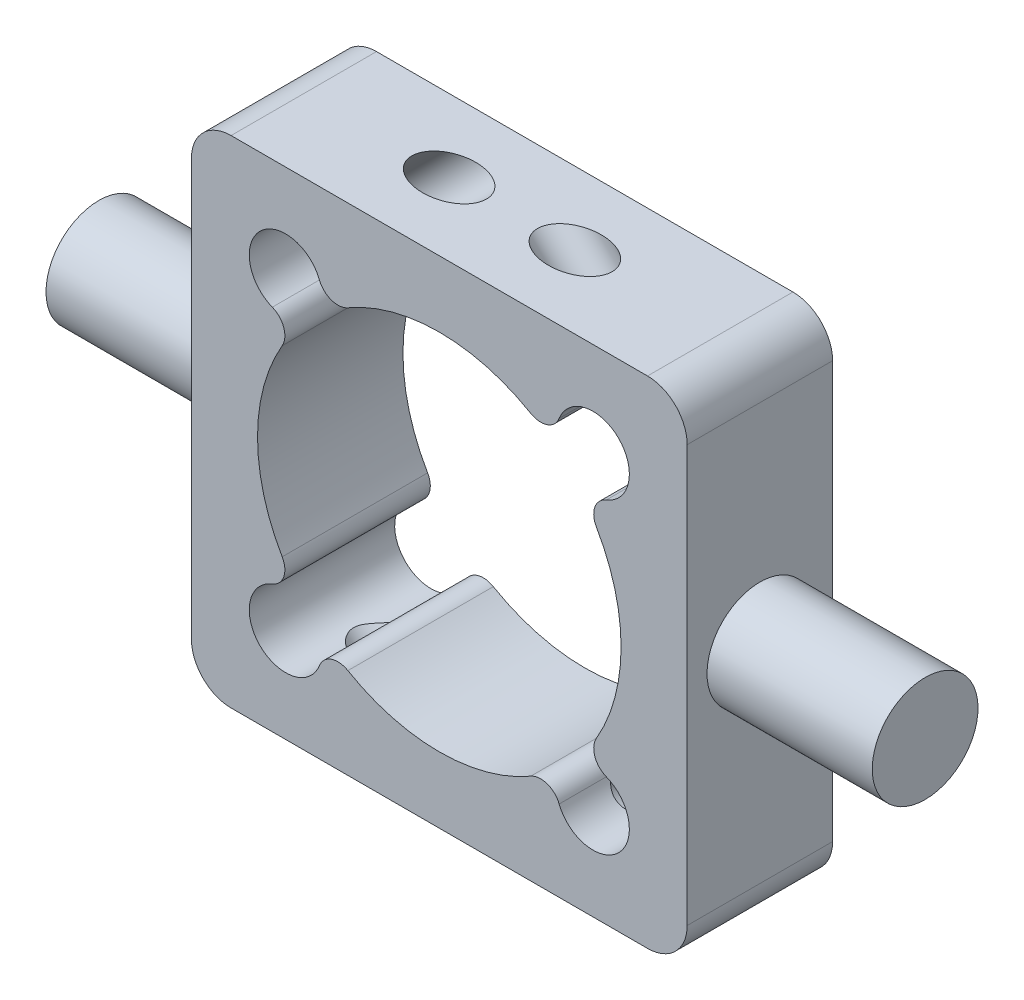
ISO-10303-21;
HEADER;
FILE_DESCRIPTION(('STEP AP214'),'2;1');
FILE_NAME('part.step','',(''),(''),'','','');
FILE_SCHEMA(('AUTOMOTIVE_DESIGN { 1 0 10303 214 1 1 1 1 }'));
ENDSEC;
DATA;
#1=APPLICATION_CONTEXT('core data for automotive mechanical design processes');
#2=APPLICATION_PROTOCOL_DEFINITION('international standard','automotive_design',2000,#1);
#3=PRODUCT_CONTEXT('',#1,'mechanical');
#4=PRODUCT('Part','Part','',(#3));
#5=PRODUCT_RELATED_PRODUCT_CATEGORY('part','',(#4));
#6=PRODUCT_DEFINITION_FORMATION('','',#4);
#7=PRODUCT_DEFINITION_CONTEXT('part definition',#1,'design');
#8=PRODUCT_DEFINITION('design','',#6,#7);
#9=PRODUCT_DEFINITION_SHAPE('','',#8);
#10=(LENGTH_UNIT() NAMED_UNIT(*) SI_UNIT(.MILLI.,.METRE.));
#11=(NAMED_UNIT(*) PLANE_ANGLE_UNIT() SI_UNIT($,.RADIAN.));
#12=(NAMED_UNIT(*) SI_UNIT($,.STERADIAN.) SOLID_ANGLE_UNIT());
#13=UNCERTAINTY_MEASURE_WITH_UNIT(LENGTH_MEASURE(1.E-05),#10,'distance_accuracy_value','');
#14=(GEOMETRIC_REPRESENTATION_CONTEXT(3) GLOBAL_UNCERTAINTY_ASSIGNED_CONTEXT((#13)) GLOBAL_UNIT_ASSIGNED_CONTEXT((#10,
#11,#12)) REPRESENTATION_CONTEXT('',''));
#15=CARTESIAN_POINT('',(0.,0.,0.));
#16=DIRECTION('',(0.,0.,1.));
#17=DIRECTION('',(1.,0.,0.));
#18=AXIS2_PLACEMENT_3D('',#15,#16,#17);
#19=CARTESIAN_POINT('',(-37.5,-37.5,22.));
#20=DIRECTION('',(0.,1.,0.));
#21=DIRECTION('',(-1.,0.,0.));
#22=AXIS2_PLACEMENT_3D('',#19,#20,#21);
#23=PLANE('',#22);
#24=DIRECTION('',(1.,0.,0.));
#25=VECTOR('',#24,1.);
#26=CARTESIAN_POINT('',(-37.5,-37.5,0.));
#27=LINE('',#26,#25);
#28=CARTESIAN_POINT('',(-31.5,-37.5,0.));
#29=VERTEX_POINT('',#28);
#30=CARTESIAN_POINT('',(31.5,-37.5,0.));
#31=VERTEX_POINT('',#30);
#32=EDGE_CURVE('E270',#29,#31,#27,.T.);
#33=ORIENTED_EDGE('',*,*,#32,.T.);
#34=DIRECTION('',(0.,0.,-1.));
#35=VECTOR('',#34,1.);
#36=CARTESIAN_POINT('',(31.5,-37.5,22.));
#37=LINE('',#36,#35);
#38=CARTESIAN_POINT('',(31.5,-37.5,22.));
#39=VERTEX_POINT('',#38);
#40=EDGE_CURVE('E309',#31,#39,#37,.F.);
#41=ORIENTED_EDGE('',*,*,#40,.T.);
#42=DIRECTION('',(1.,0.,0.));
#43=VECTOR('',#42,1.);
#44=CARTESIAN_POINT('',(-37.5,-37.5,22.));
#45=LINE('',#44,#43);
#46=CARTESIAN_POINT('',(-31.5,-37.5,22.));
#47=VERTEX_POINT('',#46);
#48=EDGE_CURVE('E257',#47,#39,#45,.T.);
#49=ORIENTED_EDGE('',*,*,#48,.F.);
#50=DIRECTION('',(0.,0.,-1.));
#51=VECTOR('',#50,1.);
#52=CARTESIAN_POINT('',(-31.5,-37.5,22.));
#53=LINE('',#52,#51);
#54=EDGE_CURVE('E306',#47,#29,#53,.T.);
#55=ORIENTED_EDGE('',*,*,#54,.T.);
#56=EDGE_LOOP('',(#33,#41,#49,#55));
#57=FACE_BOUND('',#56,.T.);
#58=CARTESIAN_POINT('',(9.51219330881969,-37.5,11.));
#59=DIRECTION('',(0.,1.,0.));
#60=DIRECTION('',(-1.,0.,0.));
#61=AXIS2_PLACEMENT_3D('',#58,#59,#60);
#62=ELLIPSE('',#61,5.65685424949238,4.00000000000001);
#63=CARTESIAN_POINT('',(3.85533905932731,-37.5,11.));
#64=VERTEX_POINT('',#63);
#65=EDGE_CURVE('E398',#64,#64,#62,.T.);
#66=ORIENTED_EDGE('',*,*,#65,.T.);
#67=EDGE_LOOP('',(#66));
#68=FACE_BOUND('',#67,.T.);
#69=CARTESIAN_POINT('',(-9.5121933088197,-37.5,11.));
#70=DIRECTION('',(0.,1.,0.));
#71=DIRECTION('',(1.,0.,0.));
#72=AXIS2_PLACEMENT_3D('',#69,#70,#71);
#73=ELLIPSE('',#72,5.65685424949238,4.00000000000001);
#74=CARTESIAN_POINT('',(-3.85533905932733,-37.5,11.));
#75=VERTEX_POINT('',#74);
#76=EDGE_CURVE('E229',#75,#75,#73,.F.);
#77=ORIENTED_EDGE('',*,*,#76,.F.);
#78=EDGE_LOOP('',(#77));
#79=FACE_BOUND('',#78,.T.);
#80=ADVANCED_FACE('F31',(#57,#68,#79),#23,.F.);
#81=CARTESIAN_POINT('',(-23.25,-23.25,22.));
#82=DIRECTION('',(0.,0.,-1.));
#83=DIRECTION('',(-1.,0.,0.));
#84=AXIS2_PLACEMENT_3D('',#81,#82,#83);
#85=CYLINDRICAL_SURFACE('',#84,5.5);
#86=DIRECTION('',(0.,0.,-1.));
#87=VECTOR('',#86,1.);
#88=CARTESIAN_POINT('',(-18.1317715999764,-25.2633896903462,22.));
#89=LINE('',#88,#87);
#90=CARTESIAN_POINT('',(-18.1317715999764,-25.2633896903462,22.));
#91=VERTEX_POINT('',#90);
#92=CARTESIAN_POINT('',(-18.1317715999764,-25.2633896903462,14.0754738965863));
#93=VERTEX_POINT('',#92);
#94=EDGE_CURVE('E228',#91,#93,#89,.T.);
#95=ORIENTED_EDGE('',*,*,#94,.T.);
#96=CARTESIAN_POINT('',(-18.1317715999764,-25.2633896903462,14.0754738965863));
#97=CARTESIAN_POINT('',(-18.1621895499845,-25.3407342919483,14.1388442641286));
#98=CARTESIAN_POINT('',(-18.1951161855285,-25.4192718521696,14.1995979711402));
#99=CARTESIAN_POINT('',(-18.2662947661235,-25.5781418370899,14.3155150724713));
#100=CARTESIAN_POINT('',(-18.3045508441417,-25.6584756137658,14.3706740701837));
#101=CARTESIAN_POINT('',(-18.3868910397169,-25.8206998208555,14.4752512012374));
#102=CARTESIAN_POINT('',(-18.4310081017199,-25.9025966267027,14.5246336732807));
#103=CARTESIAN_POINT('',(-18.5250703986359,-26.066732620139,14.6168092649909));
#104=CARTESIAN_POINT('',(-18.5750142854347,-26.1489717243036,14.659603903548));
#105=CARTESIAN_POINT('',(-18.6811008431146,-26.3134600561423,14.7383601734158));
#106=CARTESIAN_POINT('',(-18.7372751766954,-26.3957069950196,14.7742841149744));
#107=CARTESIAN_POINT('',(-18.8555342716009,-26.5589003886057,14.8385563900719));
#108=CARTESIAN_POINT('',(-18.9176183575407,-26.6398469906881,14.8669055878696));
#109=CARTESIAN_POINT('',(-19.0472775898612,-26.7993171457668,14.9155711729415));
#110=CARTESIAN_POINT('',(-19.1148357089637,-26.8778472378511,14.9359113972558));
#111=CARTESIAN_POINT('',(-19.2551967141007,-27.0318509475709,14.9683967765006));
#112=CARTESIAN_POINT('',(-19.3279989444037,-27.1073249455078,14.9805429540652));
#113=CARTESIAN_POINT('',(-19.4708448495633,-27.2471196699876,14.9957156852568));
#114=CARTESIAN_POINT('',(-19.5404497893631,-27.3118054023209,14.9995250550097));
#115=CARTESIAN_POINT('',(-19.6829683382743,-27.4375191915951,15.0003915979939));
#116=CARTESIAN_POINT('',(-19.7558830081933,-27.4985460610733,14.9974465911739));
#117=CARTESIAN_POINT('',(-19.9044532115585,-27.616498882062,14.9849091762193));
#118=CARTESIAN_POINT('',(-19.9801097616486,-27.6734232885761,14.9753142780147));
#119=CARTESIAN_POINT('',(-20.1335322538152,-27.7828276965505,14.9496907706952));
#120=CARTESIAN_POINT('',(-20.2112990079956,-27.835305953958,14.9336596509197));
#121=CARTESIAN_POINT('',(-20.4423786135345,-27.9828551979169,14.8773964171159));
#122=CARTESIAN_POINT('',(-20.5978383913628,-28.071473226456,14.8285932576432));
#123=CARTESIAN_POINT('',(-20.9099623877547,-28.2304626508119,14.7103431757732));
#124=CARTESIAN_POINT('',(-21.0666266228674,-28.3008337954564,14.6408959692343));
#125=CARTESIAN_POINT('',(-21.3976803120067,-28.4321341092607,14.4739546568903));
#126=CARTESIAN_POINT('',(-21.5717667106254,-28.4906954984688,14.3740060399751));
#127=CARTESIAN_POINT('',(-21.9129612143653,-28.5879686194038,14.1544473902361));
#128=CARTESIAN_POINT('',(-22.0800617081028,-28.6266591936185,14.0348165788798));
#129=CARTESIAN_POINT('',(-22.4375330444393,-28.6932854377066,13.7512751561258));
#130=CARTESIAN_POINT('',(-22.6254763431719,-28.7172879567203,13.5833346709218));
#131=CARTESIAN_POINT('',(-22.8903610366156,-28.7389498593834,13.3138151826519));
#132=CARTESIAN_POINT('',(-22.9758602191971,-28.7437788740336,13.2209842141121));
#133=CARTESIAN_POINT('',(-23.1400497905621,-28.7495133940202,13.0293868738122));
#134=CARTESIAN_POINT('',(-23.2187423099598,-28.7504201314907,12.9306223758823));
#135=CARTESIAN_POINT('',(-23.4023907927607,-28.7489654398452,12.680039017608));
#136=CARTESIAN_POINT('',(-23.5027125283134,-28.7449031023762,12.5247662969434));
#137=CARTESIAN_POINT('',(-23.6794268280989,-28.7339258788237,12.2013234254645));
#138=CARTESIAN_POINT('',(-23.7558727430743,-28.7270174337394,12.033183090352));
#139=CARTESIAN_POINT('',(-23.8636306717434,-28.7158733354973,11.7225659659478));
#140=CARTESIAN_POINT('',(-23.9010938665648,-28.7113819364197,11.5822730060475));
#141=CARTESIAN_POINT('',(-23.9519280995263,-28.7050887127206,11.2973836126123));
#142=CARTESIAN_POINT('',(-23.9653363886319,-28.7032827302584,11.1527941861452));
#143=CARTESIAN_POINT('',(-23.9662963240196,-28.7031570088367,10.863221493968));
#144=CARTESIAN_POINT('',(-23.9537941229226,-28.7048445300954,10.7182380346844));
#145=CARTESIAN_POINT('',(-23.9045543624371,-28.7109646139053,10.4324526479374));
#146=CARTESIAN_POINT('',(-23.8677792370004,-28.7154014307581,10.291657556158));
#147=CARTESIAN_POINT('',(-23.75725038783,-28.7269274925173,9.96795940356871));
#148=CARTESIAN_POINT('',(-23.6749707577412,-28.7343976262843,9.78803104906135));
#149=CARTESIAN_POINT('',(-23.4834760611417,-28.7458777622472,9.44286422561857));
#150=CARTESIAN_POINT('',(-23.3741826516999,-28.7498775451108,9.2776704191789));
#151=CARTESIAN_POINT('',(-23.1716436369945,-28.7500818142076,9.00902393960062));
#152=CARTESIAN_POINT('',(-23.0832819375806,-28.7482497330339,8.90181276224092));
#153=CARTESIAN_POINT('',(-22.8987023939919,-28.7395462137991,8.69452179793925));
#154=CARTESIAN_POINT('',(-22.802481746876,-28.7326729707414,8.59444457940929));
#155=CARTESIAN_POINT('',(-22.603559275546,-28.7127942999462,8.40146095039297));
#156=CARTESIAN_POINT('',(-22.500852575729,-28.6997842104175,8.30856005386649));
#157=CARTESIAN_POINT('',(-22.2901936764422,-28.6666538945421,8.13029253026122));
#158=CARTESIAN_POINT('',(-22.1822422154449,-28.6465346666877,8.04492484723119));
#159=CARTESIAN_POINT('',(-21.9613046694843,-28.5980979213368,7.88158536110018));
#160=CARTESIAN_POINT('',(-21.8482864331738,-28.5697189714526,7.80367501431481));
#161=CARTESIAN_POINT('',(-21.6190854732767,-28.5039826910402,7.6567228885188));
#162=CARTESIAN_POINT('',(-21.50290230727,-28.4666240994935,7.58768235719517));
#163=CARTESIAN_POINT('',(-21.2689183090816,-28.382321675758,7.45960113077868));
#164=CARTESIAN_POINT('',(-21.1511226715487,-28.3354039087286,7.40053402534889));
#165=CARTESIAN_POINT('',(-20.9151103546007,-28.2314580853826,7.29331080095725));
#166=CARTESIAN_POINT('',(-20.7968939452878,-28.1744356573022,7.24514864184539));
#167=CARTESIAN_POINT('',(-20.5186777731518,-28.0273167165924,7.14551271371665));
#168=CARTESIAN_POINT('',(-20.3591206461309,-27.9327343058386,7.09920661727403));
#169=CARTESIAN_POINT('',(-20.0469747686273,-27.7250125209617,7.03184742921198));
#170=CARTESIAN_POINT('',(-19.8943812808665,-27.6118860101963,7.01077691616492));
#171=CARTESIAN_POINT('',(-19.60056252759,-27.3692216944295,6.9956006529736));
#172=CARTESIAN_POINT('',(-19.4593713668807,-27.2396374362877,7.0015729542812));
#173=CARTESIAN_POINT('',(-19.1931404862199,-26.9686003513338,7.04085364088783));
#174=CARTESIAN_POINT('',(-19.068101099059,-26.8271472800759,7.07416258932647));
#175=CARTESIAN_POINT('',(-18.8414786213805,-26.5434225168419,7.16473988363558));
#176=CARTESIAN_POINT('',(-18.7391569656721,-26.4014102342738,7.2209958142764));
#177=CARTESIAN_POINT('',(-18.5524682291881,-26.1157181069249,7.355109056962));
#178=CARTESIAN_POINT('',(-18.468112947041,-25.9720372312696,7.43298048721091));
#179=CARTESIAN_POINT('',(-18.3412743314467,-25.7332190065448,7.57955995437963));
#180=CARTESIAN_POINT('',(-18.2940571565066,-25.6373573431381,7.64313592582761));
#181=CARTESIAN_POINT('',(-18.2073323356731,-25.4482492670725,7.77811023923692));
#182=CARTESIAN_POINT('',(-18.1677978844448,-25.3549947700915,7.84947997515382));
#183=CARTESIAN_POINT('',(-18.1317715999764,-25.2633896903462,7.92452610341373));
#184=B_SPLINE_CURVE_WITH_KNOTS('',3,(#96,#97,#98,#99,#100,#101,#102,#103,#104,#105,#106,#107,
#108,#109,#110,#111,#112,#113,#114,#115,#116,#117,#118,#119,#120,#121,#122,#123,#124,#125,#126,
#127,#128,#129,#130,#131,#132,#133,#134,#135,#136,#137,#138,#139,#140,#141,#142,#143,#144,#145,
#146,#147,#148,#149,#150,#151,#152,#153,#154,#155,#156,#157,#158,#159,#160,#161,#162,#163,#164,
#165,#166,#167,#168,#169,#170,#171,#172,#173,#174,#175,#176,#177,#178,#179,#180,#181,#182,#183),
.UNSPECIFIED.,.F.,.F.,(4,2,2,2,2,2,2,2,2,2,2,2,2,2,2,2,2,2,2,2,2,2,2,2,2,2,2,2,2,2,2,2,2,2,2,2,
2,2,2,2,2,2,2,4),(0.,0.313513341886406,0.62727118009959,0.942873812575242,1.25840357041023,
1.57561744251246,1.89279510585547,2.20902148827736,2.52520839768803,2.81013903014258,
3.09516164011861,3.38029103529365,3.66553176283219,4.21950976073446,4.77349538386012,
5.39851712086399,6.02420297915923,6.78054871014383,7.15914150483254,7.53761536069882,
8.09071161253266,8.64256297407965,9.07660864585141,9.509981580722,9.94425605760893,
10.3792042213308,10.9698971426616,11.5623236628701,11.9786851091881,12.395195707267,
12.8120232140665,13.228792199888,13.6487438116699,14.0687544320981,14.4876347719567,
14.9062825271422,15.4772099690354,16.0477430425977,16.6199238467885,17.192116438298,
17.7414053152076,18.2910538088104,18.6635994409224,19.0348209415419),.UNSPECIFIED.);
#185=CARTESIAN_POINT('',(-18.1317715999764,-25.2633896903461,7.92452610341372));
#186=VERTEX_POINT('',#185);
#187=EDGE_CURVE('E50',#93,#186,#184,.T.);
#188=ORIENTED_EDGE('',*,*,#187,.T.);
#189=CARTESIAN_POINT('',(-18.1317715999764,-25.2633896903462,0.));
#190=VERTEX_POINT('',#189);
#191=EDGE_CURVE('E226',#186,#190,#89,.T.);
#192=ORIENTED_EDGE('',*,*,#191,.T.);
#193=CARTESIAN_POINT('',(-23.25,-23.25,0.));
#194=DIRECTION('',(0.,0.,1.));
#195=DIRECTION('',(1.,0.,0.));
#196=AXIS2_PLACEMENT_3D('',#193,#194,#195);
#197=CIRCLE('',#196,5.5);
#198=CARTESIAN_POINT('',(-25.2633896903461,-18.1317715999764,0.));
#199=VERTEX_POINT('',#198);
#200=EDGE_CURVE('E506',#199,#190,#197,.T.);
#201=ORIENTED_EDGE('',*,*,#200,.F.);
#202=DIRECTION('',(0.,0.,-1.));
#203=VECTOR('',#202,1.);
#204=CARTESIAN_POINT('',(-25.2633896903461,-18.1317715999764,22.));
#205=LINE('',#204,#203);
#206=CARTESIAN_POINT('',(-25.2633896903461,-18.1317715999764,22.));
#207=VERTEX_POINT('',#206);
#208=EDGE_CURVE('E237',#207,#199,#205,.T.);
#209=ORIENTED_EDGE('',*,*,#208,.F.);
#210=CARTESIAN_POINT('',(-23.25,-23.25,22.));
#211=DIRECTION('',(0.,0.,1.));
#212=DIRECTION('',(1.,0.,0.));
#213=AXIS2_PLACEMENT_3D('',#210,#211,#212);
#214=CIRCLE('',#213,5.5);
#215=EDGE_CURVE('E568',#207,#91,#214,.T.);
#216=ORIENTED_EDGE('',*,*,#215,.T.);
#217=EDGE_LOOP('',(#95,#188,#192,#201,#209,#216));
#218=FACE_BOUND('',#217,.T.);
#219=ADVANCED_FACE('F224',(#218),#85,.F.);
#220=CARTESIAN_POINT('',(-15.340010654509,-26.3616022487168,22.));
#221=DIRECTION('',(0.,0.,-1.));
#222=DIRECTION('',(-1.,0.,0.));
#223=AXIS2_PLACEMENT_3D('',#220,#221,#222);
#224=CYLINDRICAL_SURFACE('',#223,3.);
#225=ORIENTED_EDGE('',*,*,#191,.F.);
#226=CARTESIAN_POINT('',(-18.1317715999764,-25.2633896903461,7.92452610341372));
#227=CARTESIAN_POINT('',(-18.1047658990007,-25.1947235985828,7.98074295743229));
#228=CARTESIAN_POINT('',(-18.0760753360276,-25.129237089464,8.03993768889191));
#229=CARTESIAN_POINT('',(-18.0165490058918,-25.0048114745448,8.16369874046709));
#230=CARTESIAN_POINT('',(-17.9857162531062,-24.9458634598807,8.22825753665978));
#231=CARTESIAN_POINT('',(-17.9232770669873,-24.8349182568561,8.36183256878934));
#232=CARTESIAN_POINT('',(-17.8916778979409,-24.782873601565,8.43081294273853));
#233=CARTESIAN_POINT('',(-17.8285228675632,-24.6850903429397,8.57312949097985));
#234=CARTESIAN_POINT('',(-17.7969670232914,-24.6393537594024,8.64646704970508));
#235=CARTESIAN_POINT('',(-17.7041044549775,-24.5117040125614,8.87150898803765));
#236=CARTESIAN_POINT('',(-17.6442416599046,-24.4387516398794,9.02898082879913));
#237=CARTESIAN_POINT('',(-17.5344855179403,-24.314358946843,9.35574197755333));
#238=CARTESIAN_POINT('',(-17.4846126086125,-24.2629624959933,9.52505457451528));
#239=CARTESIAN_POINT('',(-17.4173622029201,-24.1969361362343,9.79888313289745));
#240=CARTESIAN_POINT('',(-17.3951346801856,-24.1759309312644,9.90074310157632));
#241=CARTESIAN_POINT('',(-17.3562183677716,-24.1399775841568,10.1065940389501));
#242=CARTESIAN_POINT('',(-17.3395300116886,-24.1250299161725,10.210585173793));
#243=CARTESIAN_POINT('',(-17.3122063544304,-24.1008999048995,10.4199945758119));
#244=CARTESIAN_POINT('',(-17.3015697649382,-24.0917163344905,10.525412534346));
#245=CARTESIAN_POINT('',(-17.2866599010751,-24.0789166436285,10.7370342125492));
#246=CARTESIAN_POINT('',(-17.2823866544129,-24.0753005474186,10.8432379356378));
#247=CARTESIAN_POINT('',(-17.2802761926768,-24.0735083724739,11.0618129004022));
#248=CARTESIAN_POINT('',(-17.282819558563,-24.0756539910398,11.174190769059));
#249=CARTESIAN_POINT('',(-17.2950779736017,-24.0861295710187,11.3982693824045));
#250=CARTESIAN_POINT('',(-17.3047934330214,-24.0944598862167,11.5099700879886));
#251=CARTESIAN_POINT('',(-17.3310838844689,-24.1175138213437,11.7320146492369));
#252=CARTESIAN_POINT('',(-17.3476660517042,-24.1322441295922,11.8423569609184));
#253=CARTESIAN_POINT('',(-17.3871360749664,-24.1684325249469,12.0607857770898));
#254=CARTESIAN_POINT('',(-17.4100238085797,-24.1898904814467,12.1688723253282));
#255=CARTESIAN_POINT('',(-17.4614101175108,-24.2400564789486,12.3823184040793));
#256=CARTESIAN_POINT('',(-17.4899238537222,-24.268784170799,12.4876696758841));
#257=CARTESIAN_POINT('',(-17.5515517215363,-24.3340178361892,12.6945729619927));
#258=CARTESIAN_POINT('',(-17.5846663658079,-24.3705246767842,12.7961245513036));
#259=CARTESIAN_POINT('',(-17.6542038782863,-24.4517957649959,12.994305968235));
#260=CARTESIAN_POINT('',(-17.6906165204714,-24.49653490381,13.0909496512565));
#261=CARTESIAN_POINT('',(-17.7654320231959,-24.5949256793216,13.2787639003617));
#262=CARTESIAN_POINT('',(-17.8038340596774,-24.6485736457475,13.369936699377));
#263=CARTESIAN_POINT('',(-17.8676112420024,-24.745024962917,13.5154060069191));
#264=CARTESIAN_POINT('',(-17.892890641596,-24.7851469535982,13.5715358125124));
#265=CARTESIAN_POINT('',(-17.9430727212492,-24.8694647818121,13.6807999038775));
#266=CARTESIAN_POINT('',(-17.9679755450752,-24.9136590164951,13.7339353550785));
#267=CARTESIAN_POINT('',(-18.0169683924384,-25.0063694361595,13.837200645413));
#268=CARTESIAN_POINT('',(-18.0410541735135,-25.0549044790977,13.8873156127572));
#269=CARTESIAN_POINT('',(-18.0877094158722,-25.1560883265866,13.9840751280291));
#270=CARTESIAN_POINT('',(-18.1102774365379,-25.2087409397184,14.030716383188));
#271=CARTESIAN_POINT('',(-18.1317715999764,-25.2633896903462,14.0754738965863));
#272=B_SPLINE_CURVE_WITH_KNOTS('',3,(#226,#227,#228,#229,#230,#231,#232,#233,#234,#235,#236,
#237,#238,#239,#240,#241,#242,#243,#244,#245,#246,#247,#248,#249,#250,#251,#252,#253,#254,#255,
#256,#257,#258,#259,#260,#261,#262,#263,#264,#265,#266,#267,#268,#269,#270,#271),.UNSPECIFIED.,
.F.,.F.,(4,2,2,2,2,2,2,2,2,2,2,2,2,2,2,2,2,2,2,2,2,2,4),(0.,0.278083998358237,0.555784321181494,
0.831463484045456,1.10723071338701,1.65574958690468,2.20537942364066,2.52413748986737,
2.84292050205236,3.16163562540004,3.48035213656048,3.81722827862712,4.15412369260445,
4.49137202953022,4.82861381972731,5.16677713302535,5.50497815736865,5.84216425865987,
6.17921178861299,6.39949892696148,6.61969972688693,6.84090851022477,7.06232437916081),.UNSPECIFIED.);
#273=EDGE_CURVE('E11',#186,#93,#272,.T.);
#274=ORIENTED_EDGE('',*,*,#273,.T.);
#275=ORIENTED_EDGE('',*,*,#94,.F.);
#276=CARTESIAN_POINT('',(-15.340010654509,-26.3616022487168,22.));
#277=DIRECTION('',(0.,0.,-1.));
#278=DIRECTION('',(1.,0.,0.));
#279=AXIS2_PLACEMENT_3D('',#276,#277,#278);
#280=CIRCLE('',#279,3.);
#281=CARTESIAN_POINT('',(-13.8311571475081,-23.7686577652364,22.));
#282=VERTEX_POINT('',#281);
#283=EDGE_CURVE('E575',#91,#282,#280,.T.);
#284=ORIENTED_EDGE('',*,*,#283,.T.);
#285=DIRECTION('',(0.,0.,-1.));
#286=VECTOR('',#285,1.);
#287=CARTESIAN_POINT('',(-13.8311571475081,-23.7686577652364,22.));
#288=LINE('',#287,#286);
#289=CARTESIAN_POINT('',(-13.8311571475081,-23.7686577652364,0.));
#290=VERTEX_POINT('',#289);
#291=EDGE_CURVE('E235',#282,#290,#288,.T.);
#292=ORIENTED_EDGE('',*,*,#291,.T.);
#293=CARTESIAN_POINT('',(-15.340010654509,-26.3616022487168,0.));
#294=DIRECTION('',(0.,0.,-1.));
#295=DIRECTION('',(1.,0.,0.));
#296=AXIS2_PLACEMENT_3D('',#293,#294,#295);
#297=CIRCLE('',#296,3.);
#298=EDGE_CURVE('E233',#190,#290,#297,.T.);
#299=ORIENTED_EDGE('',*,*,#298,.F.);
#300=EDGE_LOOP('',(#225,#274,#275,#284,#292,#299));
#301=FACE_BOUND('',#300,.T.);
#302=ADVANCED_FACE('F231',(#301),#224,.T.);
#303=CARTESIAN_POINT('',(-37.5,37.5,22.));
#304=DIRECTION('',(0.,-1.,0.));
#305=DIRECTION('',(1.,0.,0.));
#306=AXIS2_PLACEMENT_3D('',#303,#304,#305);
#307=PLANE('',#306);
#308=CARTESIAN_POINT('',(-9.5121933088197,37.5,11.));
#309=DIRECTION('',(0.,-1.,0.));
#310=DIRECTION('',(1.,0.,0.));
#311=AXIS2_PLACEMENT_3D('',#308,#309,#310);
#312=ELLIPSE('',#311,5.65685424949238,4.00000000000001);
#313=CARTESIAN_POINT('',(-3.85533905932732,37.5,11.));
#314=VERTEX_POINT('',#313);
#315=EDGE_CURVE('E354',#314,#314,#312,.T.);
#316=ORIENTED_EDGE('',*,*,#315,.T.);
#317=EDGE_LOOP('',(#316));
#318=FACE_BOUND('',#317,.T.);
#319=DIRECTION('',(-1.,0.,0.));
#320=VECTOR('',#319,1.);
#321=CARTESIAN_POINT('',(-37.5,37.5,22.));
#322=LINE('',#321,#320);
#323=CARTESIAN_POINT('',(31.5,37.5,22.));
#324=VERTEX_POINT('',#323);
#325=CARTESIAN_POINT('',(-31.5,37.5,22.));
#326=VERTEX_POINT('',#325);
#327=EDGE_CURVE('E264',#324,#326,#322,.T.);
#328=ORIENTED_EDGE('',*,*,#327,.F.);
#329=DIRECTION('',(0.,0.,-1.));
#330=VECTOR('',#329,1.);
#331=CARTESIAN_POINT('',(31.5,37.5,22.));
#332=LINE('',#331,#330);
#333=CARTESIAN_POINT('',(31.5,37.5,0.));
#334=VERTEX_POINT('',#333);
#335=EDGE_CURVE('E282',#324,#334,#332,.T.);
#336=ORIENTED_EDGE('',*,*,#335,.T.);
#337=DIRECTION('',(-1.,0.,0.));
#338=VECTOR('',#337,1.);
#339=CARTESIAN_POINT('',(-37.5,37.5,0.));
#340=LINE('',#339,#338);
#341=CARTESIAN_POINT('',(-31.5,37.5,0.));
#342=VERTEX_POINT('',#341);
#343=EDGE_CURVE('E258',#334,#342,#340,.T.);
#344=ORIENTED_EDGE('',*,*,#343,.T.);
#345=DIRECTION('',(0.,0.,-1.));
#346=VECTOR('',#345,1.);
#347=CARTESIAN_POINT('',(-31.5,37.5,22.));
#348=LINE('',#347,#346);
#349=EDGE_CURVE('E280',#342,#326,#348,.F.);
#350=ORIENTED_EDGE('',*,*,#349,.T.);
#351=EDGE_LOOP('',(#328,#336,#344,#350));
#352=FACE_BOUND('',#351,.T.);
#353=CARTESIAN_POINT('',(9.51219330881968,37.5,11.));
#354=DIRECTION('',(0.,-1.,0.));
#355=DIRECTION('',(-1.,0.,0.));
#356=AXIS2_PLACEMENT_3D('',#353,#354,#355);
#357=ELLIPSE('',#356,5.65685424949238,4.00000000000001);
#358=CARTESIAN_POINT('',(3.8553390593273,37.5,11.));
#359=VERTEX_POINT('',#358);
#360=EDGE_CURVE('E353',#359,#359,#357,.F.);
#361=ORIENTED_EDGE('',*,*,#360,.F.);
#362=EDGE_LOOP('',(#361));
#363=FACE_BOUND('',#362,.T.);
#364=ADVANCED_FACE('F361',(#318,#352,#363),#307,.F.);
#365=CARTESIAN_POINT('',(23.25,23.25,22.));
#366=DIRECTION('',(0.,0.,-1.));
#367=DIRECTION('',(-1.,0.,0.));
#368=AXIS2_PLACEMENT_3D('',#365,#366,#367);
#369=CYLINDRICAL_SURFACE('',#368,5.5);
#370=DIRECTION('',(0.,0.,-1.));
#371=VECTOR('',#370,1.);
#372=CARTESIAN_POINT('',(18.1317715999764,25.2633896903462,22.));
#373=LINE('',#372,#371);
#374=CARTESIAN_POINT('',(18.1317715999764,25.2633896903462,22.));
#375=VERTEX_POINT('',#374);
#376=CARTESIAN_POINT('',(18.1317715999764,25.2633896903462,14.0754738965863));
#377=VERTEX_POINT('',#376);
#378=EDGE_CURVE('E539',#375,#377,#373,.T.);
#379=ORIENTED_EDGE('',*,*,#378,.T.);
#380=CARTESIAN_POINT('',(18.1317715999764,25.2633896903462,14.0754738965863));
#381=CARTESIAN_POINT('',(18.1621895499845,25.3407342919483,14.1388442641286));
#382=CARTESIAN_POINT('',(18.1951161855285,25.4192718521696,14.1995979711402));
#383=CARTESIAN_POINT('',(18.2662947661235,25.5781418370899,14.3155150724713));
#384=CARTESIAN_POINT('',(18.3045508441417,25.6584756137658,14.3706740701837));
#385=CARTESIAN_POINT('',(18.3868910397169,25.8206998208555,14.4752512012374));
#386=CARTESIAN_POINT('',(18.43100810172,25.9025966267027,14.5246336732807));
#387=CARTESIAN_POINT('',(18.5250703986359,26.066732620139,14.6168092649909));
#388=CARTESIAN_POINT('',(18.5750142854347,26.1489717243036,14.659603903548));
#389=CARTESIAN_POINT('',(18.6811008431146,26.3134600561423,14.7383601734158));
#390=CARTESIAN_POINT('',(18.7372751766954,26.3957069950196,14.7742841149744));
#391=CARTESIAN_POINT('',(18.8555342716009,26.5589003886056,14.8385563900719));
#392=CARTESIAN_POINT('',(18.9176183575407,26.6398469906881,14.8669055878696));
#393=CARTESIAN_POINT('',(19.0472775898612,26.7993171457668,14.9155711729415));
#394=CARTESIAN_POINT('',(19.1148357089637,26.8778472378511,14.9359113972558));
#395=CARTESIAN_POINT('',(19.2551967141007,27.0318509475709,14.9683967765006));
#396=CARTESIAN_POINT('',(19.3279989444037,27.1073249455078,14.9805429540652));
#397=CARTESIAN_POINT('',(19.4708448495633,27.2471196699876,14.9957156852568));
#398=CARTESIAN_POINT('',(19.5404497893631,27.3118054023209,14.9995250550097));
#399=CARTESIAN_POINT('',(19.6829683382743,27.4375191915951,15.0003915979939));
#400=CARTESIAN_POINT('',(19.7558830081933,27.4985460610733,14.9974465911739));
#401=CARTESIAN_POINT('',(19.9044532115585,27.616498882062,14.9849091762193));
#402=CARTESIAN_POINT('',(19.9801097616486,27.6734232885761,14.9753142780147));
#403=CARTESIAN_POINT('',(20.1335322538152,27.7828276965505,14.9496907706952));
#404=CARTESIAN_POINT('',(20.2112990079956,27.835305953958,14.9336596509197));
#405=CARTESIAN_POINT('',(20.4423786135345,27.9828551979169,14.8773964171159));
#406=CARTESIAN_POINT('',(20.5978383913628,28.071473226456,14.8285932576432));
#407=CARTESIAN_POINT('',(20.9099623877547,28.2304626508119,14.7103431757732));
#408=CARTESIAN_POINT('',(21.0666266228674,28.3008337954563,14.6408959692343));
#409=CARTESIAN_POINT('',(21.3976803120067,28.4321341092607,14.4739546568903));
#410=CARTESIAN_POINT('',(21.5717667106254,28.4906954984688,14.3740060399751));
#411=CARTESIAN_POINT('',(21.9129612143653,28.5879686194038,14.1544473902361));
#412=CARTESIAN_POINT('',(22.0800617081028,28.6266591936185,14.0348165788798));
#413=CARTESIAN_POINT('',(22.4375330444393,28.6932854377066,13.7512751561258));
#414=CARTESIAN_POINT('',(22.6254763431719,28.7172879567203,13.5833346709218));
#415=CARTESIAN_POINT('',(22.8903610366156,28.7389498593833,13.3138151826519));
#416=CARTESIAN_POINT('',(22.9758602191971,28.7437788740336,13.2209842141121));
#417=CARTESIAN_POINT('',(23.1400497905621,28.7495133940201,13.0293868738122));
#418=CARTESIAN_POINT('',(23.2187423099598,28.7504201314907,12.9306223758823));
#419=CARTESIAN_POINT('',(23.4023907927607,28.7489654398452,12.680039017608));
#420=CARTESIAN_POINT('',(23.5027125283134,28.7449031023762,12.5247662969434));
#421=CARTESIAN_POINT('',(23.6794268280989,28.7339258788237,12.2013234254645));
#422=CARTESIAN_POINT('',(23.7558727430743,28.7270174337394,12.033183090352));
#423=CARTESIAN_POINT('',(23.8636306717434,28.7158733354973,11.7225659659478));
#424=CARTESIAN_POINT('',(23.9010938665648,28.7113819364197,11.5822730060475));
#425=CARTESIAN_POINT('',(23.9519280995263,28.7050887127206,11.2973836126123));
#426=CARTESIAN_POINT('',(23.9653363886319,28.7032827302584,11.1527941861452));
#427=CARTESIAN_POINT('',(23.9662963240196,28.7031570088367,10.863221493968));
#428=CARTESIAN_POINT('',(23.9537941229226,28.7048445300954,10.7182380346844));
#429=CARTESIAN_POINT('',(23.9045543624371,28.7109646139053,10.4324526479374));
#430=CARTESIAN_POINT('',(23.8677792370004,28.7154014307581,10.291657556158));
#431=CARTESIAN_POINT('',(23.75725038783,28.7269274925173,9.96795940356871));
#432=CARTESIAN_POINT('',(23.6749707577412,28.7343976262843,9.78803104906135));
#433=CARTESIAN_POINT('',(23.4834760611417,28.7458777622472,9.44286422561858));
#434=CARTESIAN_POINT('',(23.3741826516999,28.7498775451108,9.2776704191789));
#435=CARTESIAN_POINT('',(23.1716436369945,28.7500818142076,9.00902393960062));
#436=CARTESIAN_POINT('',(23.0832819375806,28.7482497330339,8.90181276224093));
#437=CARTESIAN_POINT('',(22.8987023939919,28.7395462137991,8.69452179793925));
#438=CARTESIAN_POINT('',(22.802481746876,28.7326729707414,8.59444457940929));
#439=CARTESIAN_POINT('',(22.603559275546,28.7127942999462,8.40146095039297));
#440=CARTESIAN_POINT('',(22.500852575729,28.6997842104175,8.30856005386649));
#441=CARTESIAN_POINT('',(22.2901936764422,28.6666538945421,8.13029253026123));
#442=CARTESIAN_POINT('',(22.1822422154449,28.6465346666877,8.04492484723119));
#443=CARTESIAN_POINT('',(21.9613046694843,28.5980979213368,7.88158536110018));
#444=CARTESIAN_POINT('',(21.8482864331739,28.5697189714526,7.80367501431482));
#445=CARTESIAN_POINT('',(21.6190854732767,28.5039826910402,7.65672288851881));
#446=CARTESIAN_POINT('',(21.50290230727,28.4666240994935,7.58768235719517));
#447=CARTESIAN_POINT('',(21.2689183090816,28.382321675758,7.45960113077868));
#448=CARTESIAN_POINT('',(21.1511226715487,28.3354039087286,7.40053402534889));
#449=CARTESIAN_POINT('',(20.9151103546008,28.2314580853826,7.29331080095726));
#450=CARTESIAN_POINT('',(20.7968939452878,28.1744356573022,7.24514864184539));
#451=CARTESIAN_POINT('',(20.5186777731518,28.0273167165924,7.14551271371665));
#452=CARTESIAN_POINT('',(20.3591206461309,27.9327343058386,7.09920661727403));
#453=CARTESIAN_POINT('',(20.0469747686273,27.7250125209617,7.03184742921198));
#454=CARTESIAN_POINT('',(19.8943812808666,27.6118860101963,7.01077691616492));
#455=CARTESIAN_POINT('',(19.60056252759,27.3692216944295,6.9956006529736));
#456=CARTESIAN_POINT('',(19.4593713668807,27.2396374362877,7.0015729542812));
#457=CARTESIAN_POINT('',(19.1931404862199,26.9686003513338,7.04085364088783));
#458=CARTESIAN_POINT('',(19.068101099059,26.8271472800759,7.07416258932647));
#459=CARTESIAN_POINT('',(18.8414786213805,26.5434225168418,7.16473988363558));
#460=CARTESIAN_POINT('',(18.7391569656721,26.4014102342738,7.2209958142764));
#461=CARTESIAN_POINT('',(18.5524682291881,26.1157181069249,7.355109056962));
#462=CARTESIAN_POINT('',(18.468112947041,25.9720372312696,7.43298048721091));
#463=CARTESIAN_POINT('',(18.3412743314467,25.7332190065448,7.57955995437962));
#464=CARTESIAN_POINT('',(18.2940571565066,25.6373573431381,7.6431359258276));
#465=CARTESIAN_POINT('',(18.2073323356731,25.4482492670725,7.77811023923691));
#466=CARTESIAN_POINT('',(18.1677978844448,25.3549947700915,7.84947997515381));
#467=CARTESIAN_POINT('',(18.1317715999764,25.2633896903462,7.92452610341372));
#468=B_SPLINE_CURVE_WITH_KNOTS('',3,(#380,#381,#382,#383,#384,#385,#386,#387,#388,#389,#390,
#391,#392,#393,#394,#395,#396,#397,#398,#399,#400,#401,#402,#403,#404,#405,#406,#407,#408,#409,
#410,#411,#412,#413,#414,#415,#416,#417,#418,#419,#420,#421,#422,#423,#424,#425,#426,#427,#428,
#429,#430,#431,#432,#433,#434,#435,#436,#437,#438,#439,#440,#441,#442,#443,#444,#445,#446,#447,
#448,#449,#450,#451,#452,#453,#454,#455,#456,#457,#458,#459,#460,#461,#462,#463,#464,#465,#466,
#467),.UNSPECIFIED.,.F.,.F.,(4,2,2,2,2,2,2,2,2,2,2,2,2,2,2,2,2,2,2,2,2,2,2,2,2,2,2,2,2,2,2,2,2,
2,2,2,2,2,2,2,2,2,2,4),(0.,0.313513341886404,0.627271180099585,0.942873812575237,
1.25840357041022,1.57561744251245,1.89279510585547,2.20902148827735,2.52520839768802,
2.81013903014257,3.0951616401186,3.38029103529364,3.66553176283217,4.21950976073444,
4.77349538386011,5.39851712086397,6.02420297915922,6.78054871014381,7.15914150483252,
7.53761536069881,8.09071161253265,8.64256297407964,9.0766086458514,9.50998158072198,
9.94425605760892,10.3792042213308,10.9698971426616,11.5623236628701,11.9786851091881,
12.395195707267,12.8120232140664,13.228792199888,13.6487438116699,14.0687544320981,
14.4876347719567,14.9062825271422,15.4772099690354,16.0477430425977,16.6199238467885,
17.192116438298,17.7414053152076,18.2910538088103,18.6635994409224,19.0348209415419),.UNSPECIFIED.);
#469=CARTESIAN_POINT('',(18.1317715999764,25.2633896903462,7.92452610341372));
#470=VERTEX_POINT('',#469);
#471=EDGE_CURVE('E346',#377,#470,#468,.T.);
#472=ORIENTED_EDGE('',*,*,#471,.T.);
#473=CARTESIAN_POINT('',(18.1317715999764,25.2633896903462,0.));
#474=VERTEX_POINT('',#473);
#475=EDGE_CURVE('E538',#470,#474,#373,.T.);
#476=ORIENTED_EDGE('',*,*,#475,.T.);
#477=CARTESIAN_POINT('',(23.25,23.25,0.));
#478=DIRECTION('',(0.,0.,1.));
#479=DIRECTION('',(1.,0.,0.));
#480=AXIS2_PLACEMENT_3D('',#477,#478,#479);
#481=CIRCLE('',#480,5.5);
#482=CARTESIAN_POINT('',(25.2633896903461,18.1317715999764,0.));
#483=VERTEX_POINT('',#482);
#484=EDGE_CURVE('E527',#483,#474,#481,.T.);
#485=ORIENTED_EDGE('',*,*,#484,.F.);
#486=DIRECTION('',(0.,0.,-1.));
#487=VECTOR('',#486,1.);
#488=CARTESIAN_POINT('',(25.2633896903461,18.1317715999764,22.));
#489=LINE('',#488,#487);
#490=CARTESIAN_POINT('',(25.2633896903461,18.1317715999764,22.));
#491=VERTEX_POINT('',#490);
#492=EDGE_CURVE('E542',#491,#483,#489,.T.);
#493=ORIENTED_EDGE('',*,*,#492,.F.);
#494=CARTESIAN_POINT('',(23.25,23.25,22.));
#495=DIRECTION('',(0.,0.,1.));
#496=DIRECTION('',(1.,0.,0.));
#497=AXIS2_PLACEMENT_3D('',#494,#495,#496);
#498=CIRCLE('',#497,5.5);
#499=EDGE_CURVE('E593',#491,#375,#498,.T.);
#500=ORIENTED_EDGE('',*,*,#499,.T.);
#501=EDGE_LOOP('',(#379,#472,#476,#485,#493,#500));
#502=FACE_BOUND('',#501,.T.);
#503=ADVANCED_FACE('F357',(#502),#369,.F.);
#504=CARTESIAN_POINT('',(15.340010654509,26.3616022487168,22.));
#505=DIRECTION('',(0.,0.,-1.));
#506=DIRECTION('',(-1.,0.,0.));
#507=AXIS2_PLACEMENT_3D('',#504,#505,#506);
#508=CYLINDRICAL_SURFACE('',#507,3.);
#509=ORIENTED_EDGE('',*,*,#475,.F.);
#510=CARTESIAN_POINT('',(18.1317715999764,25.2633896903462,7.92452610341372));
#511=CARTESIAN_POINT('',(18.1047658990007,25.1947235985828,7.98074295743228));
#512=CARTESIAN_POINT('',(18.0760753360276,25.129237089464,8.03993768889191));
#513=CARTESIAN_POINT('',(18.0165490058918,25.0048114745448,8.16369874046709));
#514=CARTESIAN_POINT('',(17.9857162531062,24.9458634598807,8.22825753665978));
#515=CARTESIAN_POINT('',(17.9232770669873,24.8349182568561,8.36183256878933));
#516=CARTESIAN_POINT('',(17.8916778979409,24.782873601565,8.43081294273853));
#517=CARTESIAN_POINT('',(17.8285228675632,24.6850903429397,8.57312949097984));
#518=CARTESIAN_POINT('',(17.7969670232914,24.6393537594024,8.64646704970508));
#519=CARTESIAN_POINT('',(17.7041044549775,24.5117040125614,8.87150898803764));
#520=CARTESIAN_POINT('',(17.6442416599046,24.4387516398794,9.02898082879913));
#521=CARTESIAN_POINT('',(17.5344855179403,24.314358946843,9.35574197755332));
#522=CARTESIAN_POINT('',(17.4846126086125,24.2629624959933,9.52505457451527));
#523=CARTESIAN_POINT('',(17.4173622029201,24.1969361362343,9.79888313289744));
#524=CARTESIAN_POINT('',(17.3951346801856,24.1759309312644,9.90074310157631));
#525=CARTESIAN_POINT('',(17.3562183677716,24.1399775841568,10.1065940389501));
#526=CARTESIAN_POINT('',(17.3395300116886,24.1250299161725,10.2105851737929));
#527=CARTESIAN_POINT('',(17.3122063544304,24.1008999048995,10.4199945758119));
#528=CARTESIAN_POINT('',(17.3015697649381,24.0917163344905,10.525412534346));
#529=CARTESIAN_POINT('',(17.2866599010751,24.0789166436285,10.7370342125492));
#530=CARTESIAN_POINT('',(17.2823866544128,24.0753005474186,10.8432379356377));
#531=CARTESIAN_POINT('',(17.2802761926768,24.0735083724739,11.0618129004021));
#532=CARTESIAN_POINT('',(17.282819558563,24.0756539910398,11.174190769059));
#533=CARTESIAN_POINT('',(17.2950779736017,24.0861295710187,11.3982693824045));
#534=CARTESIAN_POINT('',(17.3047934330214,24.0944598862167,11.5099700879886));
#535=CARTESIAN_POINT('',(17.3310838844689,24.1175138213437,11.7320146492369));
#536=CARTESIAN_POINT('',(17.3476660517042,24.1322441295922,11.8423569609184));
#537=CARTESIAN_POINT('',(17.3871360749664,24.1684325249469,12.0607857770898));
#538=CARTESIAN_POINT('',(17.4100238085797,24.1898904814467,12.1688723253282));
#539=CARTESIAN_POINT('',(17.4614101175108,24.2400564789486,12.3823184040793));
#540=CARTESIAN_POINT('',(17.4899238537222,24.268784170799,12.4876696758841));
#541=CARTESIAN_POINT('',(17.5515517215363,24.3340178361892,12.6945729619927));
#542=CARTESIAN_POINT('',(17.5846663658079,24.3705246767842,12.7961245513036));
#543=CARTESIAN_POINT('',(17.6542038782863,24.4517957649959,12.994305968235));
#544=CARTESIAN_POINT('',(17.6906165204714,24.49653490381,13.0909496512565));
#545=CARTESIAN_POINT('',(17.7654320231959,24.5949256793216,13.2787639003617));
#546=CARTESIAN_POINT('',(17.8038340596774,24.6485736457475,13.369936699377));
#547=CARTESIAN_POINT('',(17.8676112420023,24.745024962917,13.5154060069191));
#548=CARTESIAN_POINT('',(17.892890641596,24.7851469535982,13.5715358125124));
#549=CARTESIAN_POINT('',(17.9430727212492,24.8694647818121,13.6807999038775));
#550=CARTESIAN_POINT('',(17.9679755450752,24.9136590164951,13.7339353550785));
#551=CARTESIAN_POINT('',(18.0169683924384,25.0063694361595,13.837200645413));
#552=CARTESIAN_POINT('',(18.0410541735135,25.0549044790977,13.8873156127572));
#553=CARTESIAN_POINT('',(18.0877094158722,25.1560883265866,13.9840751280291));
#554=CARTESIAN_POINT('',(18.1102774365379,25.2087409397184,14.030716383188));
#555=CARTESIAN_POINT('',(18.1317715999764,25.2633896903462,14.0754738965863));
#556=B_SPLINE_CURVE_WITH_KNOTS('',3,(#510,#511,#512,#513,#514,#515,#516,#517,#518,#519,#520,
#521,#522,#523,#524,#525,#526,#527,#528,#529,#530,#531,#532,#533,#534,#535,#536,#537,#538,#539,
#540,#541,#542,#543,#544,#545,#546,#547,#548,#549,#550,#551,#552,#553,#554,#555),.UNSPECIFIED.,
.F.,.F.,(4,2,2,2,2,2,2,2,2,2,2,2,2,2,2,2,2,2,2,2,2,2,4),(0.,0.278083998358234,0.555784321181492,
0.831463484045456,1.10723071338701,1.65574958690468,2.20537942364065,2.52413748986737,
2.84292050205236,3.16163562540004,3.48035213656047,3.81722827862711,4.15412369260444,
4.49137202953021,4.82861381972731,5.16677713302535,5.50497815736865,5.84216425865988,
6.17921178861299,6.39949892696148,6.61969972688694,6.84090851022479,7.06232437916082),.UNSPECIFIED.);
#557=EDGE_CURVE('E316',#470,#377,#556,.T.);
#558=ORIENTED_EDGE('',*,*,#557,.T.);
#559=ORIENTED_EDGE('',*,*,#378,.F.);
#560=CARTESIAN_POINT('',(15.340010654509,26.3616022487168,22.));
#561=DIRECTION('',(0.,0.,-1.));
#562=DIRECTION('',(1.,0.,0.));
#563=AXIS2_PLACEMENT_3D('',#560,#561,#562);
#564=CIRCLE('',#563,3.);
#565=CARTESIAN_POINT('',(13.8311571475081,23.7686577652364,22.));
#566=VERTEX_POINT('',#565);
#567=EDGE_CURVE('E594',#375,#566,#564,.T.);
#568=ORIENTED_EDGE('',*,*,#567,.T.);
#569=DIRECTION('',(0.,0.,-1.));
#570=VECTOR('',#569,1.);
#571=CARTESIAN_POINT('',(13.8311571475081,23.7686577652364,22.));
#572=LINE('',#571,#570);
#573=CARTESIAN_POINT('',(13.8311571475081,23.7686577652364,0.));
#574=VERTEX_POINT('',#573);
#575=EDGE_CURVE('E536',#566,#574,#572,.T.);
#576=ORIENTED_EDGE('',*,*,#575,.T.);
#577=CARTESIAN_POINT('',(15.340010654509,26.3616022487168,0.));
#578=DIRECTION('',(0.,0.,-1.));
#579=DIRECTION('',(1.,0.,0.));
#580=AXIS2_PLACEMENT_3D('',#577,#578,#579);
#581=CIRCLE('',#580,3.);
#582=EDGE_CURVE('E530',#474,#574,#581,.T.);
#583=ORIENTED_EDGE('',*,*,#582,.F.);
#584=EDGE_LOOP('',(#509,#558,#559,#568,#576,#583));
#585=FACE_BOUND('',#584,.T.);
#586=ADVANCED_FACE('F330',(#585),#508,.T.);
#587=CARTESIAN_POINT('',(-37.5,37.5,22.));
#588=DIRECTION('',(1.,0.,0.));
#589=DIRECTION('',(0.,1.,0.));
#590=AXIS2_PLACEMENT_3D('',#587,#588,#589);
#591=PLANE('',#590);
#592=DIRECTION('',(0.,-1.,0.));
#593=VECTOR('',#592,1.);
#594=CARTESIAN_POINT('',(-37.5,37.5,0.));
#595=LINE('',#594,#593);
#596=CARTESIAN_POINT('',(-37.5,31.5,0.));
#597=VERTEX_POINT('',#596);
#598=CARTESIAN_POINT('',(-37.5,-31.5,0.));
#599=VERTEX_POINT('',#598);
#600=EDGE_CURVE('E253',#597,#599,#595,.T.);
#601=ORIENTED_EDGE('',*,*,#600,.T.);
#602=DIRECTION('',(0.,0.,-1.));
#603=VECTOR('',#602,1.);
#604=CARTESIAN_POINT('',(-37.5,-31.5,22.));
#605=LINE('',#604,#603);
#606=CARTESIAN_POINT('',(-37.5,-31.5,22.));
#607=VERTEX_POINT('',#606);
#608=EDGE_CURVE('E314',#599,#607,#605,.F.);
#609=ORIENTED_EDGE('',*,*,#608,.T.);
#610=DIRECTION('',(0.,-1.,0.));
#611=VECTOR('',#610,1.);
#612=CARTESIAN_POINT('',(-37.5,37.5,22.));
#613=LINE('',#612,#611);
#614=CARTESIAN_POINT('',(-37.5,31.5,22.));
#615=VERTEX_POINT('',#614);
#616=EDGE_CURVE('E254',#615,#607,#613,.T.);
#617=ORIENTED_EDGE('',*,*,#616,.F.);
#618=DIRECTION('',(0.,0.,-1.));
#619=VECTOR('',#618,1.);
#620=CARTESIAN_POINT('',(-37.5,31.5,22.));
#621=LINE('',#620,#619);
#622=EDGE_CURVE('E311',#615,#597,#621,.T.);
#623=ORIENTED_EDGE('',*,*,#622,.T.);
#624=EDGE_LOOP('',(#601,#609,#617,#623));
#625=FACE_BOUND('',#624,.T.);
#626=CARTESIAN_POINT('',(-37.5,0.,11.));
#627=DIRECTION('',(1.,0.,0.));
#628=DIRECTION('',(0.,1.,0.));
#629=AXIS2_PLACEMENT_3D('',#626,#627,#628);
#630=CIRCLE('',#629,8.);
#631=CARTESIAN_POINT('',(-37.5,7.99999999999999,11.));
#632=VERTEX_POINT('',#631);
#633=EDGE_CURVE('E267',#632,#632,#630,.F.);
#634=ORIENTED_EDGE('',*,*,#633,.F.);
#635=EDGE_LOOP('',(#634));
#636=FACE_BOUND('',#635,.T.);
#637=ADVANCED_FACE('F418',(#625,#636),#591,.F.);
#638=CARTESIAN_POINT('',(-37.5,-37.5,22.));
#639=DIRECTION('',(0.,0.,1.));
#640=DIRECTION('',(1.,0.,0.));
#641=AXIS2_PLACEMENT_3D('',#638,#639,#640);
#642=PLANE('',#641);
#643=DIRECTION('',(0.,1.,0.));
#644=VECTOR('',#643,1.);
#645=CARTESIAN_POINT('',(37.5,37.5,22.));
#646=LINE('',#645,#644);
#647=CARTESIAN_POINT('',(37.5,-31.5,22.));
#648=VERTEX_POINT('',#647);
#649=CARTESIAN_POINT('',(37.5,31.5,22.));
#650=VERTEX_POINT('',#649);
#651=EDGE_CURVE('E261',#648,#650,#646,.T.);
#652=ORIENTED_EDGE('',*,*,#651,.T.);
#653=CARTESIAN_POINT('',(31.5,31.5,22.));
#654=DIRECTION('',(0.,0.,1.));
#655=DIRECTION('',(1.,0.,0.));
#656=AXIS2_PLACEMENT_3D('',#653,#654,#655);
#657=CIRCLE('',#656,6.);
#658=EDGE_CURVE('E304',#650,#324,#657,.T.);
#659=ORIENTED_EDGE('',*,*,#658,.T.);
#660=ORIENTED_EDGE('',*,*,#327,.T.);
#661=CARTESIAN_POINT('',(-31.5,31.5,22.));
#662=DIRECTION('',(0.,0.,1.));
#663=DIRECTION('',(1.,0.,0.));
#664=AXIS2_PLACEMENT_3D('',#661,#662,#663);
#665=CIRCLE('',#664,6.);
#666=EDGE_CURVE('E298',#326,#615,#665,.T.);
#667=ORIENTED_EDGE('',*,*,#666,.T.);
#668=ORIENTED_EDGE('',*,*,#616,.T.);
#669=CARTESIAN_POINT('',(-31.5,-31.5,22.));
#670=DIRECTION('',(0.,0.,1.));
#671=DIRECTION('',(1.,0.,0.));
#672=AXIS2_PLACEMENT_3D('',#669,#670,#671);
#673=CIRCLE('',#672,6.);
#674=EDGE_CURVE('E300',#607,#47,#673,.T.);
#675=ORIENTED_EDGE('',*,*,#674,.T.);
#676=ORIENTED_EDGE('',*,*,#48,.T.);
#677=CARTESIAN_POINT('',(31.5,-31.5,22.));
#678=DIRECTION('',(0.,0.,1.));
#679=DIRECTION('',(1.,0.,0.));
#680=AXIS2_PLACEMENT_3D('',#677,#678,#679);
#681=CIRCLE('',#680,6.);
#682=EDGE_CURVE('E302',#39,#648,#681,.T.);
#683=ORIENTED_EDGE('',*,*,#682,.T.);
#684=EDGE_LOOP('',(#652,#659,#660,#667,#668,#675,#676,#683));
#685=FACE_BOUND('',#684,.T.);
#686=CARTESIAN_POINT('',(-23.25,23.25,22.));
#687=DIRECTION('',(0.,0.,1.));
#688=DIRECTION('',(1.,0.,0.));
#689=AXIS2_PLACEMENT_3D('',#686,#687,#688);
#690=CIRCLE('',#689,5.5);
#691=CARTESIAN_POINT('',(-18.1317715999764,25.2633896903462,22.));
#692=VERTEX_POINT('',#691);
#693=CARTESIAN_POINT('',(-25.2633896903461,18.1317715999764,22.));
#694=VERTEX_POINT('',#693);
#695=EDGE_CURVE('E605',#692,#694,#690,.T.);
#696=ORIENTED_EDGE('',*,*,#695,.F.);
#697=CARTESIAN_POINT('',(-15.340010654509,26.3616022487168,22.));
#698=DIRECTION('',(0.,0.,-1.));
#699=DIRECTION('',(1.,0.,0.));
#700=AXIS2_PLACEMENT_3D('',#697,#698,#699);
#701=CIRCLE('',#700,3.);
#702=CARTESIAN_POINT('',(-13.8311571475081,23.7686577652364,22.));
#703=VERTEX_POINT('',#702);
#704=EDGE_CURVE('E533',#703,#692,#701,.T.);
#705=ORIENTED_EDGE('',*,*,#704,.F.);
#706=CARTESIAN_POINT('',(0.,0.,22.));
#707=DIRECTION('',(0.,0.,1.));
#708=DIRECTION('',(1.,0.,0.));
#709=AXIS2_PLACEMENT_3D('',#706,#707,#708);
#710=CIRCLE('',#709,27.5);
#711=EDGE_CURVE('E496',#566,#703,#710,.T.);
#712=ORIENTED_EDGE('',*,*,#711,.F.);
#713=ORIENTED_EDGE('',*,*,#567,.F.);
#714=ORIENTED_EDGE('',*,*,#499,.F.);
#715=CARTESIAN_POINT('',(26.3616022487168,15.340010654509,22.));
#716=DIRECTION('',(0.,0.,-1.));
#717=DIRECTION('',(-1.,0.,0.));
#718=AXIS2_PLACEMENT_3D('',#715,#716,#717);
#719=CIRCLE('',#718,3.);
#720=CARTESIAN_POINT('',(23.7686577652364,13.8311571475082,22.));
#721=VERTEX_POINT('',#720);
#722=EDGE_CURVE('E591',#721,#491,#719,.T.);
#723=ORIENTED_EDGE('',*,*,#722,.F.);
#724=CARTESIAN_POINT('',(0.,0.,22.));
#725=DIRECTION('',(0.,0.,1.));
#726=DIRECTION('',(1.,0.,0.));
#727=AXIS2_PLACEMENT_3D('',#724,#725,#726);
#728=CIRCLE('',#727,27.5);
#729=CARTESIAN_POINT('',(23.7686577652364,-13.8311571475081,22.));
#730=VERTEX_POINT('',#729);
#731=EDGE_CURVE('E589',#730,#721,#728,.T.);
#732=ORIENTED_EDGE('',*,*,#731,.F.);
#733=CARTESIAN_POINT('',(26.3616022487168,-15.340010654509,22.));
#734=DIRECTION('',(0.,0.,-1.));
#735=DIRECTION('',(1.,0.,0.));
#736=AXIS2_PLACEMENT_3D('',#733,#734,#735);
#737=CIRCLE('',#736,3.);
#738=CARTESIAN_POINT('',(25.2633896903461,-18.1317715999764,22.));
#739=VERTEX_POINT('',#738);
#740=EDGE_CURVE('E587',#739,#730,#737,.T.);
#741=ORIENTED_EDGE('',*,*,#740,.F.);
#742=CARTESIAN_POINT('',(23.25,-23.25,22.));
#743=DIRECTION('',(0.,0.,1.));
#744=DIRECTION('',(1.,0.,0.));
#745=AXIS2_PLACEMENT_3D('',#742,#743,#744);
#746=CIRCLE('',#745,5.5);
#747=CARTESIAN_POINT('',(18.1317715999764,-25.2633896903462,22.));
#748=VERTEX_POINT('',#747);
#749=EDGE_CURVE('E585',#748,#739,#746,.T.);
#750=ORIENTED_EDGE('',*,*,#749,.F.);
#751=CARTESIAN_POINT('',(15.340010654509,-26.3616022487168,22.));
#752=DIRECTION('',(0.,0.,-1.));
#753=DIRECTION('',(-1.,0.,0.));
#754=AXIS2_PLACEMENT_3D('',#751,#752,#753);
#755=CIRCLE('',#754,3.);
#756=CARTESIAN_POINT('',(13.8311571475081,-23.7686577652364,22.));
#757=VERTEX_POINT('',#756);
#758=EDGE_CURVE('E583',#757,#748,#755,.T.);
#759=ORIENTED_EDGE('',*,*,#758,.F.);
#760=CARTESIAN_POINT('',(0.,0.,22.));
#761=DIRECTION('',(0.,0.,1.));
#762=DIRECTION('',(1.,0.,0.));
#763=AXIS2_PLACEMENT_3D('',#760,#761,#762);
#764=CIRCLE('',#763,27.5);
#765=EDGE_CURVE('E560',#282,#757,#764,.T.);
#766=ORIENTED_EDGE('',*,*,#765,.F.);
#767=ORIENTED_EDGE('',*,*,#283,.F.);
#768=ORIENTED_EDGE('',*,*,#215,.F.);
#769=CARTESIAN_POINT('',(-26.3616022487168,-15.340010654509,22.));
#770=DIRECTION('',(0.,0.,-1.));
#771=DIRECTION('',(1.,0.,0.));
#772=AXIS2_PLACEMENT_3D('',#769,#770,#771);
#773=CIRCLE('',#772,3.);
#774=CARTESIAN_POINT('',(-23.7686577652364,-13.8311571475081,22.));
#775=VERTEX_POINT('',#774);
#776=EDGE_CURVE('E574',#775,#207,#773,.T.);
#777=ORIENTED_EDGE('',*,*,#776,.F.);
#778=CARTESIAN_POINT('',(0.,0.,22.));
#779=DIRECTION('',(0.,0.,1.));
#780=DIRECTION('',(1.,0.,0.));
#781=AXIS2_PLACEMENT_3D('',#778,#779,#780);
#782=CIRCLE('',#781,27.5);
#783=CARTESIAN_POINT('',(-23.7686577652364,13.8311571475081,22.));
#784=VERTEX_POINT('',#783);
#785=EDGE_CURVE('E578',#784,#775,#782,.T.);
#786=ORIENTED_EDGE('',*,*,#785,.F.);
#787=CARTESIAN_POINT('',(-26.3616022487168,15.340010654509,22.));
#788=DIRECTION('',(0.,0.,-1.));
#789=DIRECTION('',(1.,0.,0.));
#790=AXIS2_PLACEMENT_3D('',#787,#788,#789);
#791=CIRCLE('',#790,3.);
#792=EDGE_CURVE('E607',#694,#784,#791,.T.);
#793=ORIENTED_EDGE('',*,*,#792,.F.);
#794=EDGE_LOOP('',(#696,#705,#712,#713,#714,#723,#732,#741,#750,#759,#766,#767,#768,#777,#786,#793));
#795=FACE_BOUND('',#794,.T.);
#796=ADVANCED_FACE('F414',(#685,#795),#642,.T.);
#797=CARTESIAN_POINT('',(-37.5,-37.5,0.));
#798=DIRECTION('',(0.,0.,1.));
#799=DIRECTION('',(1.,0.,0.));
#800=AXIS2_PLACEMENT_3D('',#797,#798,#799);
#801=PLANE('',#800);
#802=ORIENTED_EDGE('',*,*,#343,.F.);
#803=CARTESIAN_POINT('',(31.5,31.5,0.));
#804=DIRECTION('',(0.,0.,1.));
#805=DIRECTION('',(1.,0.,0.));
#806=AXIS2_PLACEMENT_3D('',#803,#804,#805);
#807=CIRCLE('',#806,6.);
#808=CARTESIAN_POINT('',(37.5,31.5,0.));
#809=VERTEX_POINT('',#808);
#810=EDGE_CURVE('E291',#334,#809,#807,.F.);
#811=ORIENTED_EDGE('',*,*,#810,.T.);
#812=DIRECTION('',(0.,1.,0.));
#813=VECTOR('',#812,1.);
#814=CARTESIAN_POINT('',(37.5,37.5,0.));
#815=LINE('',#814,#813);
#816=CARTESIAN_POINT('',(37.5,-31.5,0.));
#817=VERTEX_POINT('',#816);
#818=EDGE_CURVE('E273',#817,#809,#815,.T.);
#819=ORIENTED_EDGE('',*,*,#818,.F.);
#820=CARTESIAN_POINT('',(31.5,-31.5,0.));
#821=DIRECTION('',(0.,0.,1.));
#822=DIRECTION('',(1.,0.,0.));
#823=AXIS2_PLACEMENT_3D('',#820,#821,#822);
#824=CIRCLE('',#823,6.);
#825=EDGE_CURVE('E289',#817,#31,#824,.F.);
#826=ORIENTED_EDGE('',*,*,#825,.T.);
#827=ORIENTED_EDGE('',*,*,#32,.F.);
#828=CARTESIAN_POINT('',(-31.5,-31.5,0.));
#829=DIRECTION('',(0.,0.,1.));
#830=DIRECTION('',(1.,0.,0.));
#831=AXIS2_PLACEMENT_3D('',#828,#829,#830);
#832=CIRCLE('',#831,6.);
#833=EDGE_CURVE('E287',#29,#599,#832,.F.);
#834=ORIENTED_EDGE('',*,*,#833,.T.);
#835=ORIENTED_EDGE('',*,*,#600,.F.);
#836=CARTESIAN_POINT('',(-31.5,31.5,0.));
#837=DIRECTION('',(0.,0.,1.));
#838=DIRECTION('',(1.,0.,0.));
#839=AXIS2_PLACEMENT_3D('',#836,#837,#838);
#840=CIRCLE('',#839,6.);
#841=EDGE_CURVE('E285',#597,#342,#840,.F.);
#842=ORIENTED_EDGE('',*,*,#841,.T.);
#843=EDGE_LOOP('',(#802,#811,#819,#826,#827,#834,#835,#842));
#844=FACE_BOUND('',#843,.T.);
#845=CARTESIAN_POINT('',(-15.340010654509,26.3616022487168,0.));
#846=DIRECTION('',(0.,0.,-1.));
#847=DIRECTION('',(1.,0.,0.));
#848=AXIS2_PLACEMENT_3D('',#845,#846,#847);
#849=CIRCLE('',#848,3.);
#850=CARTESIAN_POINT('',(-13.8311571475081,23.7686577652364,0.));
#851=VERTEX_POINT('',#850);
#852=CARTESIAN_POINT('',(-18.1317715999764,25.2633896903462,0.));
#853=VERTEX_POINT('',#852);
#854=EDGE_CURVE('E479',#851,#853,#849,.T.);
#855=ORIENTED_EDGE('',*,*,#854,.T.);
#856=CARTESIAN_POINT('',(-23.25,23.25,0.));
#857=DIRECTION('',(0.,0.,1.));
#858=DIRECTION('',(1.,0.,0.));
#859=AXIS2_PLACEMENT_3D('',#856,#857,#858);
#860=CIRCLE('',#859,5.5);
#861=CARTESIAN_POINT('',(-25.2633896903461,18.1317715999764,0.));
#862=VERTEX_POINT('',#861);
#863=EDGE_CURVE('E482',#853,#862,#860,.T.);
#864=ORIENTED_EDGE('',*,*,#863,.T.);
#865=CARTESIAN_POINT('',(-26.3616022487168,15.340010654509,0.));
#866=DIRECTION('',(0.,0.,-1.));
#867=DIRECTION('',(1.,0.,0.));
#868=AXIS2_PLACEMENT_3D('',#865,#866,#867);
#869=CIRCLE('',#868,3.);
#870=CARTESIAN_POINT('',(-23.7686577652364,13.8311571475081,0.));
#871=VERTEX_POINT('',#870);
#872=EDGE_CURVE('E490',#862,#871,#869,.T.);
#873=ORIENTED_EDGE('',*,*,#872,.T.);
#874=CARTESIAN_POINT('',(0.,0.,0.));
#875=DIRECTION('',(0.,0.,1.));
#876=DIRECTION('',(1.,0.,0.));
#877=AXIS2_PLACEMENT_3D('',#874,#875,#876);
#878=CIRCLE('',#877,27.5);
#879=CARTESIAN_POINT('',(-23.7686577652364,-13.8311571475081,0.));
#880=VERTEX_POINT('',#879);
#881=EDGE_CURVE('E500',#871,#880,#878,.T.);
#882=ORIENTED_EDGE('',*,*,#881,.T.);
#883=CARTESIAN_POINT('',(-26.3616022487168,-15.340010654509,0.));
#884=DIRECTION('',(0.,0.,-1.));
#885=DIRECTION('',(1.,0.,0.));
#886=AXIS2_PLACEMENT_3D('',#883,#884,#885);
#887=CIRCLE('',#886,3.);
#888=EDGE_CURVE('E503',#880,#199,#887,.T.);
#889=ORIENTED_EDGE('',*,*,#888,.T.);
#890=ORIENTED_EDGE('',*,*,#200,.T.);
#891=ORIENTED_EDGE('',*,*,#298,.T.);
#892=CARTESIAN_POINT('',(0.,0.,0.));
#893=DIRECTION('',(0.,0.,1.));
#894=DIRECTION('',(1.,0.,0.));
#895=AXIS2_PLACEMENT_3D('',#892,#893,#894);
#896=CIRCLE('',#895,27.5);
#897=CARTESIAN_POINT('',(13.8311571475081,-23.7686577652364,0.));
#898=VERTEX_POINT('',#897);
#899=EDGE_CURVE('E509',#290,#898,#896,.T.);
#900=ORIENTED_EDGE('',*,*,#899,.T.);
#901=CARTESIAN_POINT('',(15.340010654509,-26.3616022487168,0.));
#902=DIRECTION('',(0.,0.,-1.));
#903=DIRECTION('',(-1.,0.,0.));
#904=AXIS2_PLACEMENT_3D('',#901,#902,#903);
#905=CIRCLE('',#904,3.);
#906=CARTESIAN_POINT('',(18.1317715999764,-25.2633896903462,0.));
#907=VERTEX_POINT('',#906);
#908=EDGE_CURVE('E512',#898,#907,#905,.T.);
#909=ORIENTED_EDGE('',*,*,#908,.T.);
#910=CARTESIAN_POINT('',(23.25,-23.25,0.));
#911=DIRECTION('',(0.,0.,1.));
#912=DIRECTION('',(1.,0.,0.));
#913=AXIS2_PLACEMENT_3D('',#910,#911,#912);
#914=CIRCLE('',#913,5.5);
#915=CARTESIAN_POINT('',(25.2633896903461,-18.1317715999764,0.));
#916=VERTEX_POINT('',#915);
#917=EDGE_CURVE('E515',#907,#916,#914,.T.);
#918=ORIENTED_EDGE('',*,*,#917,.T.);
#919=CARTESIAN_POINT('',(26.3616022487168,-15.340010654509,0.));
#920=DIRECTION('',(0.,0.,-1.));
#921=DIRECTION('',(1.,0.,0.));
#922=AXIS2_PLACEMENT_3D('',#919,#920,#921);
#923=CIRCLE('',#922,3.);
#924=CARTESIAN_POINT('',(23.7686577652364,-13.8311571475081,0.));
#925=VERTEX_POINT('',#924);
#926=EDGE_CURVE('E518',#916,#925,#923,.T.);
#927=ORIENTED_EDGE('',*,*,#926,.T.);
#928=CARTESIAN_POINT('',(0.,0.,0.));
#929=DIRECTION('',(0.,0.,1.));
#930=DIRECTION('',(1.,0.,0.));
#931=AXIS2_PLACEMENT_3D('',#928,#929,#930);
#932=CIRCLE('',#931,27.5);
#933=CARTESIAN_POINT('',(23.7686577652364,13.8311571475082,0.));
#934=VERTEX_POINT('',#933);
#935=EDGE_CURVE('E521',#925,#934,#932,.T.);
#936=ORIENTED_EDGE('',*,*,#935,.T.);
#937=CARTESIAN_POINT('',(26.3616022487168,15.340010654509,0.));
#938=DIRECTION('',(0.,0.,-1.));
#939=DIRECTION('',(-1.,0.,0.));
#940=AXIS2_PLACEMENT_3D('',#937,#938,#939);
#941=CIRCLE('',#940,3.);
#942=EDGE_CURVE('E524',#934,#483,#941,.T.);
#943=ORIENTED_EDGE('',*,*,#942,.T.);
#944=ORIENTED_EDGE('',*,*,#484,.T.);
#945=ORIENTED_EDGE('',*,*,#582,.T.);
#946=CARTESIAN_POINT('',(0.,0.,0.));
#947=DIRECTION('',(0.,0.,1.));
#948=DIRECTION('',(1.,0.,0.));
#949=AXIS2_PLACEMENT_3D('',#946,#947,#948);
#950=CIRCLE('',#949,27.5);
#951=EDGE_CURVE('E485',#574,#851,#950,.T.);
#952=ORIENTED_EDGE('',*,*,#951,.T.);
#953=EDGE_LOOP('',(#855,#864,#873,#882,#889,#890,#891,#900,#909,#918,#927,#936,#943,#944,#945,#952));
#954=FACE_BOUND('',#953,.T.);
#955=ADVANCED_FACE('F417',(#844,#954),#801,.F.);
#956=CARTESIAN_POINT('',(37.5,37.5,22.));
#957=DIRECTION('',(-1.,0.,0.));
#958=DIRECTION('',(0.,-1.,0.));
#959=AXIS2_PLACEMENT_3D('',#956,#957,#958);
#960=PLANE('',#959);
#961=CARTESIAN_POINT('',(37.5,0.,11.));
#962=DIRECTION('',(-1.,0.,0.));
#963=DIRECTION('',(0.,-1.,0.));
#964=AXIS2_PLACEMENT_3D('',#961,#962,#963);
#965=CIRCLE('',#964,8.);
#966=CARTESIAN_POINT('',(37.5,-8.00000000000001,11.));
#967=VERTEX_POINT('',#966);
#968=EDGE_CURVE('E870',#967,#967,#965,.T.);
#969=ORIENTED_EDGE('',*,*,#968,.T.);
#970=EDGE_LOOP('',(#969));
#971=FACE_BOUND('',#970,.T.);
#972=ORIENTED_EDGE('',*,*,#818,.T.);
#973=DIRECTION('',(0.,0.,-1.));
#974=VECTOR('',#973,1.);
#975=CARTESIAN_POINT('',(37.5,31.5,22.));
#976=LINE('',#975,#974);
#977=EDGE_CURVE('E296',#809,#650,#976,.F.);
#978=ORIENTED_EDGE('',*,*,#977,.T.);
#979=ORIENTED_EDGE('',*,*,#651,.F.);
#980=DIRECTION('',(0.,0.,-1.));
#981=VECTOR('',#980,1.);
#982=CARTESIAN_POINT('',(37.5,-31.5,22.));
#983=LINE('',#982,#981);
#984=EDGE_CURVE('E293',#648,#817,#983,.T.);
#985=ORIENTED_EDGE('',*,*,#984,.T.);
#986=EDGE_LOOP('',(#972,#978,#979,#985));
#987=FACE_BOUND('',#986,.T.);
#988=ADVANCED_FACE('F410',(#971,#987),#960,.F.);
#989=CARTESIAN_POINT('',(-15.340010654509,26.3616022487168,22.));
#990=DIRECTION('',(0.,0.,-1.));
#991=DIRECTION('',(-1.,0.,0.));
#992=AXIS2_PLACEMENT_3D('',#989,#990,#991);
#993=CYLINDRICAL_SURFACE('',#992,3.);
#994=CARTESIAN_POINT('',(-18.1317715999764,25.2633896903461,7.92452610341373));
#995=CARTESIAN_POINT('',(-18.1047658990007,25.1947235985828,7.98074295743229));
#996=CARTESIAN_POINT('',(-18.0760753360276,25.129237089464,8.03993768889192));
#997=CARTESIAN_POINT('',(-18.0165490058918,25.0048114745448,8.1636987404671));
#998=CARTESIAN_POINT('',(-17.9857162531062,24.9458634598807,8.22825753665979));
#999=CARTESIAN_POINT('',(-17.9232770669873,24.8349182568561,8.36183256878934));
#1000=CARTESIAN_POINT('',(-17.8916778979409,24.782873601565,8.43081294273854));
#1001=CARTESIAN_POINT('',(-17.8285228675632,24.6850903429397,8.57312949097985));
#1002=CARTESIAN_POINT('',(-17.7969670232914,24.6393537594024,8.64646704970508));
#1003=CARTESIAN_POINT('',(-17.7041044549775,24.5117040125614,8.87150898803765));
#1004=CARTESIAN_POINT('',(-17.6442416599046,24.4387516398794,9.02898082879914));
#1005=CARTESIAN_POINT('',(-17.5344855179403,24.314358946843,9.35574197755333));
#1006=CARTESIAN_POINT('',(-17.4846126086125,24.2629624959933,9.52505457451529));
#1007=CARTESIAN_POINT('',(-17.4173622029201,24.1969361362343,9.79888313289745));
#1008=CARTESIAN_POINT('',(-17.3951346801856,24.1759309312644,9.90074310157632));
#1009=CARTESIAN_POINT('',(-17.3562183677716,24.1399775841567,10.1065940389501));
#1010=CARTESIAN_POINT('',(-17.3395300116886,24.1250299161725,10.210585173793));
#1011=CARTESIAN_POINT('',(-17.3122063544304,24.1008999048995,10.4199945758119));
#1012=CARTESIAN_POINT('',(-17.3015697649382,24.0917163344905,10.525412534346));
#1013=CARTESIAN_POINT('',(-17.2866599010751,24.0789166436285,10.7370342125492));
#1014=CARTESIAN_POINT('',(-17.2823866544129,24.0753005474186,10.8432379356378));
#1015=CARTESIAN_POINT('',(-17.2802761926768,24.0735083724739,11.0618129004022));
#1016=CARTESIAN_POINT('',(-17.282819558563,24.0756539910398,11.174190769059));
#1017=CARTESIAN_POINT('',(-17.2950779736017,24.0861295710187,11.3982693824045));
#1018=CARTESIAN_POINT('',(-17.3047934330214,24.0944598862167,11.5099700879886));
#1019=CARTESIAN_POINT('',(-17.3310838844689,24.1175138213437,11.7320146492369));
#1020=CARTESIAN_POINT('',(-17.3476660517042,24.1322441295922,11.8423569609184));
#1021=CARTESIAN_POINT('',(-17.3871360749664,24.1684325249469,12.0607857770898));
#1022=CARTESIAN_POINT('',(-17.4100238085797,24.1898904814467,12.1688723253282));
#1023=CARTESIAN_POINT('',(-17.4614101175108,24.2400564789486,12.3823184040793));
#1024=CARTESIAN_POINT('',(-17.4899238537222,24.268784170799,12.4876696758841));
#1025=CARTESIAN_POINT('',(-17.5515517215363,24.3340178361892,12.6945729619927));
#1026=CARTESIAN_POINT('',(-17.5846663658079,24.3705246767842,12.7961245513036));
#1027=CARTESIAN_POINT('',(-17.6542038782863,24.4517957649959,12.9943059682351));
#1028=CARTESIAN_POINT('',(-17.6906165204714,24.49653490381,13.0909496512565));
#1029=CARTESIAN_POINT('',(-17.7654320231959,24.5949256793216,13.2787639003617));
#1030=CARTESIAN_POINT('',(-17.8038340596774,24.6485736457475,13.369936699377));
#1031=CARTESIAN_POINT('',(-17.8676112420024,24.7450249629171,13.5154060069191));
#1032=CARTESIAN_POINT('',(-17.892890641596,24.7851469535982,13.5715358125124));
#1033=CARTESIAN_POINT('',(-17.9430727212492,24.8694647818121,13.6807999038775));
#1034=CARTESIAN_POINT('',(-17.9679755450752,24.9136590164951,13.7339353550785));
#1035=CARTESIAN_POINT('',(-18.0169683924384,25.0063694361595,13.837200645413));
#1036=CARTESIAN_POINT('',(-18.0410541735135,25.0549044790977,13.8873156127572));
#1037=CARTESIAN_POINT('',(-18.0877094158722,25.1560883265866,13.9840751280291));
#1038=CARTESIAN_POINT('',(-18.1102774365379,25.2087409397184,14.030716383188));
#1039=CARTESIAN_POINT('',(-18.1317715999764,25.2633896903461,14.0754738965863));
#1040=B_SPLINE_CURVE_WITH_KNOTS('',3,(#994,#995,#996,#997,#998,#999,#1000,#1001,#1002,#1003,
#1004,#1005,#1006,#1007,#1008,#1009,#1010,#1011,#1012,#1013,#1014,#1015,#1016,#1017,#1018,#1019,
#1020,#1021,#1022,#1023,#1024,#1025,#1026,#1027,#1028,#1029,#1030,#1031,#1032,#1033,#1034,#1035,
#1036,#1037,#1038,#1039),.UNSPECIFIED.,.F.,.F.,(4,2,2,2,2,2,2,2,2,2,2,2,2,2,2,2,2,2,2,2,2,2,4),
(0.,0.27808399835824,0.555784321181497,0.831463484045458,1.10723071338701,1.65574958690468,
2.20537942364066,2.52413748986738,2.84292050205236,3.16163562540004,3.48035213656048,
3.81722827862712,4.15412369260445,4.49137202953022,4.82861381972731,5.16677713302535,
5.50497815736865,5.84216425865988,6.179211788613,6.39949892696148,6.61969972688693,
6.84090851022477,7.0623243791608),.UNSPECIFIED.);
#1041=CARTESIAN_POINT('',(-18.1317715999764,25.2633896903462,7.92452610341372));
#1042=VERTEX_POINT('',#1041);
#1043=CARTESIAN_POINT('',(-18.1317715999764,25.2633896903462,14.0754738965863));
#1044=VERTEX_POINT('',#1043);
#1045=EDGE_CURVE('E400',#1042,#1044,#1040,.T.);
#1046=ORIENTED_EDGE('',*,*,#1045,.F.);
#1047=DIRECTION('',(0.,0.,-1.));
#1048=VECTOR('',#1047,1.);
#1049=CARTESIAN_POINT('',(-18.1317715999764,25.2633896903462,22.));
#1050=LINE('',#1049,#1048);
#1051=EDGE_CURVE('E249',#1042,#853,#1050,.T.);
#1052=ORIENTED_EDGE('',*,*,#1051,.T.);
#1053=ORIENTED_EDGE('',*,*,#854,.F.);
#1054=DIRECTION('',(0.,0.,-1.));
#1055=VECTOR('',#1054,1.);
#1056=CARTESIAN_POINT('',(-13.8311571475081,23.7686577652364,22.));
#1057=LINE('',#1056,#1055);
#1058=EDGE_CURVE('E534',#703,#851,#1057,.T.);
#1059=ORIENTED_EDGE('',*,*,#1058,.F.);
#1060=ORIENTED_EDGE('',*,*,#704,.T.);
#1061=EDGE_CURVE('E250',#692,#1044,#1050,.T.);
#1062=ORIENTED_EDGE('',*,*,#1061,.T.);
#1063=EDGE_LOOP('',(#1046,#1052,#1053,#1059,#1060,#1062));
#1064=FACE_BOUND('',#1063,.T.);
#1065=ADVANCED_FACE('F405',(#1064),#993,.T.);
#1066=CARTESIAN_POINT('',(-23.25,23.25,22.));
#1067=DIRECTION('',(0.,0.,-1.));
#1068=DIRECTION('',(-1.,0.,0.));
#1069=AXIS2_PLACEMENT_3D('',#1066,#1067,#1068);
#1070=CYLINDRICAL_SURFACE('',#1069,5.5);
#1071=CARTESIAN_POINT('',(-18.1317715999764,25.2633896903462,14.0754738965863));
#1072=CARTESIAN_POINT('',(-18.1621895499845,25.3407342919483,14.1388442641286));
#1073=CARTESIAN_POINT('',(-18.1951161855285,25.4192718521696,14.1995979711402));
#1074=CARTESIAN_POINT('',(-18.2662947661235,25.5781418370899,14.3155150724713));
#1075=CARTESIAN_POINT('',(-18.3045508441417,25.6584756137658,14.3706740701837));
#1076=CARTESIAN_POINT('',(-18.3868910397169,25.8206998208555,14.4752512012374));
#1077=CARTESIAN_POINT('',(-18.43100810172,25.9025966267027,14.5246336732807));
#1078=CARTESIAN_POINT('',(-18.5250703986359,26.066732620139,14.6168092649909));
#1079=CARTESIAN_POINT('',(-18.5750142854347,26.1489717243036,14.659603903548));
#1080=CARTESIAN_POINT('',(-18.6811008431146,26.3134600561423,14.7383601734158));
#1081=CARTESIAN_POINT('',(-18.7372751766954,26.3957069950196,14.7742841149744));
#1082=CARTESIAN_POINT('',(-18.8555342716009,26.5589003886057,14.8385563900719));
#1083=CARTESIAN_POINT('',(-18.9176183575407,26.6398469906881,14.8669055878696));
#1084=CARTESIAN_POINT('',(-19.0472775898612,26.7993171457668,14.9155711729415));
#1085=CARTESIAN_POINT('',(-19.1148357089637,26.8778472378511,14.9359113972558));
#1086=CARTESIAN_POINT('',(-19.2551967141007,27.0318509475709,14.9683967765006));
#1087=CARTESIAN_POINT('',(-19.3279989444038,27.1073249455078,14.9805429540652));
#1088=CARTESIAN_POINT('',(-19.4708448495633,27.2471196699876,14.9957156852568));
#1089=CARTESIAN_POINT('',(-19.5404497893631,27.3118054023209,14.9995250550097));
#1090=CARTESIAN_POINT('',(-19.6829683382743,27.4375191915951,15.0003915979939));
#1091=CARTESIAN_POINT('',(-19.7558830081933,27.4985460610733,14.9974465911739));
#1092=CARTESIAN_POINT('',(-19.9044532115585,27.616498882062,14.9849091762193));
#1093=CARTESIAN_POINT('',(-19.9801097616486,27.6734232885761,14.9753142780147));
#1094=CARTESIAN_POINT('',(-20.1335322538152,27.7828276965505,14.9496907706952));
#1095=CARTESIAN_POINT('',(-20.2112990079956,27.835305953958,14.9336596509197));
#1096=CARTESIAN_POINT('',(-20.4423786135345,27.9828551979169,14.8773964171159));
#1097=CARTESIAN_POINT('',(-20.5978383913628,28.071473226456,14.8285932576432));
#1098=CARTESIAN_POINT('',(-20.9099623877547,28.2304626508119,14.7103431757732));
#1099=CARTESIAN_POINT('',(-21.0666266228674,28.3008337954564,14.6408959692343));
#1100=CARTESIAN_POINT('',(-21.3976803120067,28.4321341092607,14.4739546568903));
#1101=CARTESIAN_POINT('',(-21.5717667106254,28.4906954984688,14.3740060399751));
#1102=CARTESIAN_POINT('',(-21.9129612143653,28.5879686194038,14.1544473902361));
#1103=CARTESIAN_POINT('',(-22.0800617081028,28.6266591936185,14.0348165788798));
#1104=CARTESIAN_POINT('',(-22.4375330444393,28.6932854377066,13.7512751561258));
#1105=CARTESIAN_POINT('',(-22.6254763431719,28.7172879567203,13.5833346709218));
#1106=CARTESIAN_POINT('',(-22.8903610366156,28.7389498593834,13.3138151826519));
#1107=CARTESIAN_POINT('',(-22.9758602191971,28.7437788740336,13.2209842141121));
#1108=CARTESIAN_POINT('',(-23.1400497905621,28.7495133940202,13.0293868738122));
#1109=CARTESIAN_POINT('',(-23.2187423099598,28.7504201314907,12.9306223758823));
#1110=CARTESIAN_POINT('',(-23.4023907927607,28.7489654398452,12.680039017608));
#1111=CARTESIAN_POINT('',(-23.5027125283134,28.7449031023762,12.5247662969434));
#1112=CARTESIAN_POINT('',(-23.6794268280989,28.7339258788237,12.2013234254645));
#1113=CARTESIAN_POINT('',(-23.7558727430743,28.7270174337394,12.033183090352));
#1114=CARTESIAN_POINT('',(-23.8636306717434,28.7158733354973,11.7225659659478));
#1115=CARTESIAN_POINT('',(-23.9010938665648,28.7113819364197,11.5822730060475));
#1116=CARTESIAN_POINT('',(-23.9519280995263,28.7050887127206,11.2973836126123));
#1117=CARTESIAN_POINT('',(-23.9653363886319,28.7032827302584,11.1527941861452));
#1118=CARTESIAN_POINT('',(-23.9662963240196,28.7031570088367,10.863221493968));
#1119=CARTESIAN_POINT('',(-23.9537941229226,28.7048445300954,10.7182380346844));
#1120=CARTESIAN_POINT('',(-23.9045543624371,28.7109646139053,10.4324526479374));
#1121=CARTESIAN_POINT('',(-23.8677792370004,28.7154014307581,10.291657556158));
#1122=CARTESIAN_POINT('',(-23.75725038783,28.7269274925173,9.9679594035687));
#1123=CARTESIAN_POINT('',(-23.6749707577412,28.7343976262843,9.78803104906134));
#1124=CARTESIAN_POINT('',(-23.4834760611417,28.7458777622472,9.44286422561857));
#1125=CARTESIAN_POINT('',(-23.3741826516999,28.7498775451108,9.2776704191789));
#1126=CARTESIAN_POINT('',(-23.1716436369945,28.7500818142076,9.00902393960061));
#1127=CARTESIAN_POINT('',(-23.0832819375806,28.7482497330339,8.90181276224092));
#1128=CARTESIAN_POINT('',(-22.8987023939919,28.7395462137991,8.69452179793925));
#1129=CARTESIAN_POINT('',(-22.802481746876,28.7326729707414,8.59444457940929));
#1130=CARTESIAN_POINT('',(-22.603559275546,28.7127942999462,8.40146095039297));
#1131=CARTESIAN_POINT('',(-22.500852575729,28.6997842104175,8.30856005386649));
#1132=CARTESIAN_POINT('',(-22.2901936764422,28.6666538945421,8.13029253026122));
#1133=CARTESIAN_POINT('',(-22.1822422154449,28.6465346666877,8.04492484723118));
#1134=CARTESIAN_POINT('',(-21.9613046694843,28.5980979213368,7.88158536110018));
#1135=CARTESIAN_POINT('',(-21.8482864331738,28.5697189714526,7.80367501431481));
#1136=CARTESIAN_POINT('',(-21.6190854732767,28.5039826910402,7.6567228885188));
#1137=CARTESIAN_POINT('',(-21.50290230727,28.4666240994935,7.58768235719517));
#1138=CARTESIAN_POINT('',(-21.2689183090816,28.382321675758,7.45960113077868));
#1139=CARTESIAN_POINT('',(-21.1511226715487,28.3354039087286,7.40053402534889));
#1140=CARTESIAN_POINT('',(-20.9151103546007,28.2314580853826,7.29331080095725));
#1141=CARTESIAN_POINT('',(-20.7968939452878,28.1744356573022,7.24514864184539));
#1142=CARTESIAN_POINT('',(-20.5186777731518,28.0273167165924,7.14551271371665));
#1143=CARTESIAN_POINT('',(-20.3591206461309,27.9327343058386,7.09920661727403));
#1144=CARTESIAN_POINT('',(-20.0469747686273,27.7250125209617,7.03184742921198));
#1145=CARTESIAN_POINT('',(-19.8943812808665,27.6118860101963,7.01077691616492));
#1146=CARTESIAN_POINT('',(-19.60056252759,27.3692216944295,6.9956006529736));
#1147=CARTESIAN_POINT('',(-19.4593713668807,27.2396374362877,7.0015729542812));
#1148=CARTESIAN_POINT('',(-19.1931404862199,26.9686003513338,7.04085364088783));
#1149=CARTESIAN_POINT('',(-19.068101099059,26.8271472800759,7.07416258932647));
#1150=CARTESIAN_POINT('',(-18.8414786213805,26.5434225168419,7.16473988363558));
#1151=CARTESIAN_POINT('',(-18.7391569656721,26.4014102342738,7.2209958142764));
#1152=CARTESIAN_POINT('',(-18.5524682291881,26.1157181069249,7.355109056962));
#1153=CARTESIAN_POINT('',(-18.468112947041,25.9720372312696,7.43298048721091));
#1154=CARTESIAN_POINT('',(-18.3412743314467,25.7332190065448,7.57955995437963));
#1155=CARTESIAN_POINT('',(-18.2940571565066,25.6373573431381,7.64313592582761));
#1156=CARTESIAN_POINT('',(-18.2073323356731,25.4482492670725,7.77811023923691));
#1157=CARTESIAN_POINT('',(-18.1677978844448,25.3549947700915,7.84947997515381));
#1158=CARTESIAN_POINT('',(-18.1317715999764,25.2633896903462,7.92452610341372));
#1159=B_SPLINE_CURVE_WITH_KNOTS('',3,(#1071,#1072,#1073,#1074,#1075,#1076,#1077,#1078,#1079,
#1080,#1081,#1082,#1083,#1084,#1085,#1086,#1087,#1088,#1089,#1090,#1091,#1092,#1093,#1094,#1095,
#1096,#1097,#1098,#1099,#1100,#1101,#1102,#1103,#1104,#1105,#1106,#1107,#1108,#1109,#1110,#1111,
#1112,#1113,#1114,#1115,#1116,#1117,#1118,#1119,#1120,#1121,#1122,#1123,#1124,#1125,#1126,#1127,
#1128,#1129,#1130,#1131,#1132,#1133,#1134,#1135,#1136,#1137,#1138,#1139,#1140,#1141,#1142,#1143,
#1144,#1145,#1146,#1147,#1148,#1149,#1150,#1151,#1152,#1153,#1154,#1155,#1156,#1157,#1158),
.UNSPECIFIED.,.F.,.F.,(4,2,2,2,2,2,2,2,2,2,2,2,2,2,2,2,2,2,2,2,2,2,2,2,2,2,2,2,2,2,2,2,2,2,2,2,
2,2,2,2,2,2,2,4),(0.,0.313513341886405,0.627271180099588,0.94287381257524,1.25840357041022,
1.57561744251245,1.89279510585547,2.20902148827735,2.52520839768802,2.81013903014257,
3.0951616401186,3.38029103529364,3.66553176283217,4.21950976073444,4.77349538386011,
5.39851712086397,6.02420297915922,6.78054871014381,7.15914150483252,7.5376153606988,
8.09071161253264,8.64256297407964,9.07660864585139,9.50998158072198,9.94425605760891,
10.3792042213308,10.9698971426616,11.5623236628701,11.9786851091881,12.395195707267,
12.8120232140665,13.228792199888,13.6487438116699,14.0687544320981,14.4876347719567,
14.9062825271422,15.4772099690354,16.0477430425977,16.6199238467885,17.192116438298,
17.7414053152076,18.2910538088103,18.6635994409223,19.0348209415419),.UNSPECIFIED.);
#1160=EDGE_CURVE('E324',#1044,#1042,#1159,.T.);
#1161=ORIENTED_EDGE('',*,*,#1160,.F.);
#1162=ORIENTED_EDGE('',*,*,#1061,.F.);
#1163=ORIENTED_EDGE('',*,*,#695,.T.);
#1164=DIRECTION('',(0.,0.,-1.));
#1165=VECTOR('',#1164,1.);
#1166=CARTESIAN_POINT('',(-25.2633896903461,18.1317715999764,22.));
#1167=LINE('',#1166,#1165);
#1168=EDGE_CURVE('E247',#694,#862,#1167,.T.);
#1169=ORIENTED_EDGE('',*,*,#1168,.T.);
#1170=ORIENTED_EDGE('',*,*,#863,.F.);
#1171=ORIENTED_EDGE('',*,*,#1051,.F.);
#1172=EDGE_LOOP('',(#1161,#1162,#1163,#1169,#1170,#1171));
#1173=FACE_BOUND('',#1172,.T.);
#1174=ADVANCED_FACE('F409',(#1173),#1070,.F.);
#1175=CARTESIAN_POINT('',(-26.3616022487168,15.340010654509,22.));
#1176=DIRECTION('',(0.,0.,-1.));
#1177=DIRECTION('',(-1.,0.,0.));
#1178=AXIS2_PLACEMENT_3D('',#1175,#1176,#1177);
#1179=CYLINDRICAL_SURFACE('',#1178,3.);
#1180=ORIENTED_EDGE('',*,*,#872,.F.);
#1181=ORIENTED_EDGE('',*,*,#1168,.F.);
#1182=ORIENTED_EDGE('',*,*,#792,.T.);
#1183=DIRECTION('',(0.,0.,-1.));
#1184=VECTOR('',#1183,1.);
#1185=CARTESIAN_POINT('',(-23.7686577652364,13.8311571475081,22.));
#1186=LINE('',#1185,#1184);
#1187=EDGE_CURVE('E245',#784,#871,#1186,.T.);
#1188=ORIENTED_EDGE('',*,*,#1187,.T.);
#1189=EDGE_LOOP('',(#1180,#1181,#1182,#1188));
#1190=FACE_BOUND('',#1189,.T.);
#1191=ADVANCED_FACE('F620',(#1190),#1179,.T.);
#1192=CARTESIAN_POINT('',(0.,0.,22.));
#1193=DIRECTION('',(0.,0.,-1.));
#1194=DIRECTION('',(-1.,0.,0.));
#1195=AXIS2_PLACEMENT_3D('',#1192,#1193,#1194);
#1196=CYLINDRICAL_SURFACE('',#1195,27.5);
#1197=ORIENTED_EDGE('',*,*,#881,.F.);
#1198=ORIENTED_EDGE('',*,*,#1187,.F.);
#1199=ORIENTED_EDGE('',*,*,#785,.T.);
#1200=DIRECTION('',(0.,0.,-1.));
#1201=VECTOR('',#1200,1.);
#1202=CARTESIAN_POINT('',(-23.7686577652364,-13.8311571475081,22.));
#1203=LINE('',#1202,#1201);
#1204=EDGE_CURVE('E243',#775,#880,#1203,.T.);
#1205=ORIENTED_EDGE('',*,*,#1204,.T.);
#1206=EDGE_LOOP('',(#1197,#1198,#1199,#1205));
#1207=FACE_BOUND('',#1206,.T.);
#1208=ADVANCED_FACE('F615',(#1207),#1196,.F.);
#1209=CARTESIAN_POINT('',(-26.3616022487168,-15.340010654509,22.));
#1210=DIRECTION('',(0.,0.,-1.));
#1211=DIRECTION('',(-1.,0.,0.));
#1212=AXIS2_PLACEMENT_3D('',#1209,#1210,#1211);
#1213=CYLINDRICAL_SURFACE('',#1212,3.);
#1214=ORIENTED_EDGE('',*,*,#888,.F.);
#1215=ORIENTED_EDGE('',*,*,#1204,.F.);
#1216=ORIENTED_EDGE('',*,*,#776,.T.);
#1217=ORIENTED_EDGE('',*,*,#208,.T.);
#1218=EDGE_LOOP('',(#1214,#1215,#1216,#1217));
#1219=FACE_BOUND('',#1218,.T.);
#1220=ADVANCED_FACE('F616',(#1219),#1213,.T.);
#1221=CARTESIAN_POINT('',(0.,0.,22.));
#1222=DIRECTION('',(0.,0.,-1.));
#1223=DIRECTION('',(-1.,0.,0.));
#1224=AXIS2_PLACEMENT_3D('',#1221,#1222,#1223);
#1225=CYLINDRICAL_SURFACE('',#1224,27.5);
#1226=ORIENTED_EDGE('',*,*,#899,.F.);
#1227=ORIENTED_EDGE('',*,*,#291,.F.);
#1228=ORIENTED_EDGE('',*,*,#765,.T.);
#1229=DIRECTION('',(0.,0.,-1.));
#1230=VECTOR('',#1229,1.);
#1231=CARTESIAN_POINT('',(13.8311571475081,-23.7686577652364,22.));
#1232=LINE('',#1231,#1230);
#1233=EDGE_CURVE('E238',#757,#898,#1232,.T.);
#1234=ORIENTED_EDGE('',*,*,#1233,.T.);
#1235=EDGE_LOOP('',(#1226,#1227,#1228,#1234));
#1236=FACE_BOUND('',#1235,.T.);
#1237=ADVANCED_FACE('F557',(#1236),#1225,.F.);
#1238=CARTESIAN_POINT('',(15.340010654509,-26.3616022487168,22.));
#1239=DIRECTION('',(0.,0.,-1.));
#1240=DIRECTION('',(-1.,0.,0.));
#1241=AXIS2_PLACEMENT_3D('',#1238,#1239,#1240);
#1242=CYLINDRICAL_SURFACE('',#1241,3.);
#1243=CARTESIAN_POINT('',(18.1317715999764,-25.2633896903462,7.92452610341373));
#1244=CARTESIAN_POINT('',(18.1047658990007,-25.1947235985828,7.98074295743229));
#1245=CARTESIAN_POINT('',(18.0760753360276,-25.129237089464,8.03993768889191));
#1246=CARTESIAN_POINT('',(18.0165490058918,-25.0048114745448,8.16369874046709));
#1247=CARTESIAN_POINT('',(17.9857162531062,-24.9458634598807,8.22825753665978));
#1248=CARTESIAN_POINT('',(17.9232770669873,-24.8349182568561,8.36183256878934));
#1249=CARTESIAN_POINT('',(17.8916778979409,-24.782873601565,8.43081294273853));
#1250=CARTESIAN_POINT('',(17.8285228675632,-24.6850903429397,8.57312949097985));
#1251=CARTESIAN_POINT('',(17.7969670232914,-24.6393537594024,8.64646704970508));
#1252=CARTESIAN_POINT('',(17.7041044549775,-24.5117040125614,8.87150898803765));
#1253=CARTESIAN_POINT('',(17.6442416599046,-24.4387516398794,9.02898082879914));
#1254=CARTESIAN_POINT('',(17.5344855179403,-24.314358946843,9.35574197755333));
#1255=CARTESIAN_POINT('',(17.4846126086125,-24.2629624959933,9.52505457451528));
#1256=CARTESIAN_POINT('',(17.4173622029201,-24.1969361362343,9.79888313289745));
#1257=CARTESIAN_POINT('',(17.3951346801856,-24.1759309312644,9.90074310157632));
#1258=CARTESIAN_POINT('',(17.3562183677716,-24.1399775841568,10.1065940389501));
#1259=CARTESIAN_POINT('',(17.3395300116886,-24.1250299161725,10.210585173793));
#1260=CARTESIAN_POINT('',(17.3122063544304,-24.1008999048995,10.4199945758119));
#1261=CARTESIAN_POINT('',(17.3015697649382,-24.0917163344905,10.525412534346));
#1262=CARTESIAN_POINT('',(17.2866599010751,-24.0789166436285,10.7370342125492));
#1263=CARTESIAN_POINT('',(17.2823866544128,-24.0753005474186,10.8432379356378));
#1264=CARTESIAN_POINT('',(17.2802761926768,-24.0735083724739,11.0618129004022));
#1265=CARTESIAN_POINT('',(17.282819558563,-24.0756539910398,11.174190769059));
#1266=CARTESIAN_POINT('',(17.2950779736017,-24.0861295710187,11.3982693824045));
#1267=CARTESIAN_POINT('',(17.3047934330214,-24.0944598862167,11.5099700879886));
#1268=CARTESIAN_POINT('',(17.3310838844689,-24.1175138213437,11.7320146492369));
#1269=CARTESIAN_POINT('',(17.3476660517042,-24.1322441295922,11.8423569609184));
#1270=CARTESIAN_POINT('',(17.3871360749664,-24.1684325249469,12.0607857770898));
#1271=CARTESIAN_POINT('',(17.4100238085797,-24.1898904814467,12.1688723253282));
#1272=CARTESIAN_POINT('',(17.4614101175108,-24.2400564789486,12.3823184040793));
#1273=CARTESIAN_POINT('',(17.4899238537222,-24.268784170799,12.4876696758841));
#1274=CARTESIAN_POINT('',(17.5515517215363,-24.3340178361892,12.6945729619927));
#1275=CARTESIAN_POINT('',(17.5846663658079,-24.3705246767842,12.7961245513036));
#1276=CARTESIAN_POINT('',(17.6542038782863,-24.4517957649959,12.9943059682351));
#1277=CARTESIAN_POINT('',(17.6906165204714,-24.49653490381,13.0909496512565));
#1278=CARTESIAN_POINT('',(17.7654320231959,-24.5949256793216,13.2787639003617));
#1279=CARTESIAN_POINT('',(17.8038340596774,-24.6485736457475,13.369936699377));
#1280=CARTESIAN_POINT('',(17.8676112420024,-24.7450249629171,13.5154060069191));
#1281=CARTESIAN_POINT('',(17.892890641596,-24.7851469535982,13.5715358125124));
#1282=CARTESIAN_POINT('',(17.9430727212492,-24.8694647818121,13.6807999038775));
#1283=CARTESIAN_POINT('',(17.9679755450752,-24.9136590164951,13.7339353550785));
#1284=CARTESIAN_POINT('',(18.0169683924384,-25.0063694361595,13.837200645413));
#1285=CARTESIAN_POINT('',(18.0410541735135,-25.0549044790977,13.8873156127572));
#1286=CARTESIAN_POINT('',(18.0877094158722,-25.1560883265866,13.9840751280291));
#1287=CARTESIAN_POINT('',(18.1102774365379,-25.2087409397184,14.030716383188));
#1288=CARTESIAN_POINT('',(18.1317715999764,-25.2633896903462,14.0754738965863));
#1289=B_SPLINE_CURVE_WITH_KNOTS('',3,(#1243,#1244,#1245,#1246,#1247,#1248,#1249,#1250,#1251,
#1252,#1253,#1254,#1255,#1256,#1257,#1258,#1259,#1260,#1261,#1262,#1263,#1264,#1265,#1266,#1267,
#1268,#1269,#1270,#1271,#1272,#1273,#1274,#1275,#1276,#1277,#1278,#1279,#1280,#1281,#1282,#1283,
#1284,#1285,#1286,#1287,#1288),.UNSPECIFIED.,.F.,.F.,(4,2,2,2,2,2,2,2,2,2,2,2,2,2,2,2,2,2,2,2,2,
2,4),(0.,0.278083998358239,0.555784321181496,0.831463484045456,1.10723071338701,
1.65574958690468,2.20537942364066,2.52413748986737,2.84292050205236,3.16163562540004,
3.48035213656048,3.81722827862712,4.15412369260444,4.49137202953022,4.82861381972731,
5.16677713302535,5.50497815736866,5.84216425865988,6.179211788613,6.39949892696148,
6.61969972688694,6.84090851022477,7.06232437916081),.UNSPECIFIED.);
#1290=CARTESIAN_POINT('',(18.1317715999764,-25.2633896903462,7.92452610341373));
#1291=VERTEX_POINT('',#1290);
#1292=CARTESIAN_POINT('',(18.1317715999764,-25.2633896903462,14.0754738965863));
#1293=VERTEX_POINT('',#1292);
#1294=EDGE_CURVE('E56',#1291,#1293,#1289,.T.);
#1295=ORIENTED_EDGE('',*,*,#1294,.F.);
#1296=DIRECTION('',(0.,0.,-1.));
#1297=VECTOR('',#1296,1.);
#1298=CARTESIAN_POINT('',(18.1317715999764,-25.2633896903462,22.));
#1299=LINE('',#1298,#1297);
#1300=EDGE_CURVE('E550',#1291,#907,#1299,.T.);
#1301=ORIENTED_EDGE('',*,*,#1300,.T.);
#1302=ORIENTED_EDGE('',*,*,#908,.F.);
#1303=ORIENTED_EDGE('',*,*,#1233,.F.);
#1304=ORIENTED_EDGE('',*,*,#758,.T.);
#1305=EDGE_CURVE('E551',#748,#1293,#1299,.T.);
#1306=ORIENTED_EDGE('',*,*,#1305,.T.);
#1307=EDGE_LOOP('',(#1295,#1301,#1302,#1303,#1304,#1306));
#1308=FACE_BOUND('',#1307,.T.);
#1309=ADVANCED_FACE('F380',(#1308),#1242,.T.);
#1310=CARTESIAN_POINT('',(23.25,-23.25,22.));
#1311=DIRECTION('',(0.,0.,-1.));
#1312=DIRECTION('',(-1.,0.,0.));
#1313=AXIS2_PLACEMENT_3D('',#1310,#1311,#1312);
#1314=CYLINDRICAL_SURFACE('',#1313,5.5);
#1315=CARTESIAN_POINT('',(18.1317715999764,-25.2633896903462,14.0754738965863));
#1316=CARTESIAN_POINT('',(18.1621895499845,-25.3407342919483,14.1388442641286));
#1317=CARTESIAN_POINT('',(18.1951161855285,-25.4192718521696,14.1995979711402));
#1318=CARTESIAN_POINT('',(18.2662947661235,-25.5781418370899,14.3155150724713));
#1319=CARTESIAN_POINT('',(18.3045508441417,-25.6584756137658,14.3706740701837));
#1320=CARTESIAN_POINT('',(18.3868910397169,-25.8206998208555,14.4752512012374));
#1321=CARTESIAN_POINT('',(18.43100810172,-25.9025966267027,14.5246336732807));
#1322=CARTESIAN_POINT('',(18.5250703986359,-26.066732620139,14.6168092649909));
#1323=CARTESIAN_POINT('',(18.5750142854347,-26.1489717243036,14.659603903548));
#1324=CARTESIAN_POINT('',(18.6811008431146,-26.3134600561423,14.7383601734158));
#1325=CARTESIAN_POINT('',(18.7372751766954,-26.3957069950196,14.7742841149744));
#1326=CARTESIAN_POINT('',(18.8555342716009,-26.5589003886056,14.8385563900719));
#1327=CARTESIAN_POINT('',(18.9176183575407,-26.6398469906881,14.8669055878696));
#1328=CARTESIAN_POINT('',(19.0472775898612,-26.7993171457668,14.9155711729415));
#1329=CARTESIAN_POINT('',(19.1148357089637,-26.8778472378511,14.9359113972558));
#1330=CARTESIAN_POINT('',(19.2551967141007,-27.0318509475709,14.9683967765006));
#1331=CARTESIAN_POINT('',(19.3279989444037,-27.1073249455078,14.9805429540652));
#1332=CARTESIAN_POINT('',(19.4708448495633,-27.2471196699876,14.9957156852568));
#1333=CARTESIAN_POINT('',(19.5404497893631,-27.3118054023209,14.9995250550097));
#1334=CARTESIAN_POINT('',(19.6829683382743,-27.4375191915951,15.0003915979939));
#1335=CARTESIAN_POINT('',(19.7558830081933,-27.4985460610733,14.9974465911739));
#1336=CARTESIAN_POINT('',(19.9044532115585,-27.616498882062,14.9849091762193));
#1337=CARTESIAN_POINT('',(19.9801097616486,-27.6734232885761,14.9753142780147));
#1338=CARTESIAN_POINT('',(20.1335322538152,-27.7828276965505,14.9496907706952));
#1339=CARTESIAN_POINT('',(20.2112990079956,-27.835305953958,14.9336596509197));
#1340=CARTESIAN_POINT('',(20.4423786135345,-27.9828551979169,14.8773964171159));
#1341=CARTESIAN_POINT('',(20.5978383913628,-28.071473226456,14.8285932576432));
#1342=CARTESIAN_POINT('',(20.9099623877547,-28.2304626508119,14.7103431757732));
#1343=CARTESIAN_POINT('',(21.0666266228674,-28.3008337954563,14.6408959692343));
#1344=CARTESIAN_POINT('',(21.3976803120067,-28.4321341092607,14.4739546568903));
#1345=CARTESIAN_POINT('',(21.5717667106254,-28.4906954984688,14.3740060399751));
#1346=CARTESIAN_POINT('',(21.9129612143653,-28.5879686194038,14.1544473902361));
#1347=CARTESIAN_POINT('',(22.0800617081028,-28.6266591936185,14.0348165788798));
#1348=CARTESIAN_POINT('',(22.4375330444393,-28.6932854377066,13.7512751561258));
#1349=CARTESIAN_POINT('',(22.6254763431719,-28.7172879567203,13.5833346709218));
#1350=CARTESIAN_POINT('',(22.8903610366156,-28.7389498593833,13.3138151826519));
#1351=CARTESIAN_POINT('',(22.9758602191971,-28.7437788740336,13.2209842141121));
#1352=CARTESIAN_POINT('',(23.1400497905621,-28.7495133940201,13.0293868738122));
#1353=CARTESIAN_POINT('',(23.2187423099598,-28.7504201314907,12.9306223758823));
#1354=CARTESIAN_POINT('',(23.4023907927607,-28.7489654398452,12.680039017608));
#1355=CARTESIAN_POINT('',(23.5027125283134,-28.7449031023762,12.5247662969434));
#1356=CARTESIAN_POINT('',(23.6794268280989,-28.7339258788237,12.2013234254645));
#1357=CARTESIAN_POINT('',(23.7558727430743,-28.7270174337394,12.033183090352));
#1358=CARTESIAN_POINT('',(23.8636306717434,-28.7158733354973,11.7225659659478));
#1359=CARTESIAN_POINT('',(23.9010938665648,-28.7113819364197,11.5822730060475));
#1360=CARTESIAN_POINT('',(23.9519280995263,-28.7050887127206,11.2973836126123));
#1361=CARTESIAN_POINT('',(23.9653363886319,-28.7032827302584,11.1527941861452));
#1362=CARTESIAN_POINT('',(23.9662963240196,-28.7031570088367,10.863221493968));
#1363=CARTESIAN_POINT('',(23.9537941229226,-28.7048445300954,10.7182380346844));
#1364=CARTESIAN_POINT('',(23.9045543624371,-28.7109646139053,10.4324526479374));
#1365=CARTESIAN_POINT('',(23.8677792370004,-28.7154014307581,10.291657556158));
#1366=CARTESIAN_POINT('',(23.75725038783,-28.7269274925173,9.96795940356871));
#1367=CARTESIAN_POINT('',(23.6749707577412,-28.7343976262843,9.78803104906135));
#1368=CARTESIAN_POINT('',(23.4834760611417,-28.7458777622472,9.44286422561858));
#1369=CARTESIAN_POINT('',(23.3741826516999,-28.7498775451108,9.2776704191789));
#1370=CARTESIAN_POINT('',(23.1716436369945,-28.7500818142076,9.00902393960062));
#1371=CARTESIAN_POINT('',(23.0832819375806,-28.7482497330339,8.90181276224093));
#1372=CARTESIAN_POINT('',(22.8987023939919,-28.7395462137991,8.69452179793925));
#1373=CARTESIAN_POINT('',(22.802481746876,-28.7326729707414,8.59444457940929));
#1374=CARTESIAN_POINT('',(22.603559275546,-28.7127942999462,8.40146095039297));
#1375=CARTESIAN_POINT('',(22.500852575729,-28.6997842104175,8.30856005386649));
#1376=CARTESIAN_POINT('',(22.2901936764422,-28.6666538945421,8.13029253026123));
#1377=CARTESIAN_POINT('',(22.1822422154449,-28.6465346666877,8.04492484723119));
#1378=CARTESIAN_POINT('',(21.9613046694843,-28.5980979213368,7.88158536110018));
#1379=CARTESIAN_POINT('',(21.8482864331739,-28.5697189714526,7.80367501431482));
#1380=CARTESIAN_POINT('',(21.6190854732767,-28.5039826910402,7.65672288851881));
#1381=CARTESIAN_POINT('',(21.50290230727,-28.4666240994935,7.58768235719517));
#1382=CARTESIAN_POINT('',(21.2689183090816,-28.382321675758,7.45960113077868));
#1383=CARTESIAN_POINT('',(21.1511226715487,-28.3354039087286,7.40053402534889));
#1384=CARTESIAN_POINT('',(20.9151103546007,-28.2314580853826,7.29331080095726));
#1385=CARTESIAN_POINT('',(20.7968939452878,-28.1744356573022,7.24514864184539));
#1386=CARTESIAN_POINT('',(20.5186777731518,-28.0273167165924,7.14551271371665));
#1387=CARTESIAN_POINT('',(20.3591206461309,-27.9327343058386,7.09920661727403));
#1388=CARTESIAN_POINT('',(20.0469747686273,-27.7250125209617,7.03184742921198));
#1389=CARTESIAN_POINT('',(19.8943812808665,-27.6118860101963,7.01077691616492));
#1390=CARTESIAN_POINT('',(19.60056252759,-27.3692216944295,6.9956006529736));
#1391=CARTESIAN_POINT('',(19.4593713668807,-27.2396374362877,7.0015729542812));
#1392=CARTESIAN_POINT('',(19.1931404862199,-26.9686003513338,7.04085364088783));
#1393=CARTESIAN_POINT('',(19.068101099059,-26.8271472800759,7.07416258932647));
#1394=CARTESIAN_POINT('',(18.8414786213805,-26.5434225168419,7.16473988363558));
#1395=CARTESIAN_POINT('',(18.7391569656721,-26.4014102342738,7.2209958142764));
#1396=CARTESIAN_POINT('',(18.5524682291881,-26.1157181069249,7.355109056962));
#1397=CARTESIAN_POINT('',(18.468112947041,-25.9720372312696,7.43298048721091));
#1398=CARTESIAN_POINT('',(18.3412743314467,-25.7332190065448,7.57955995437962));
#1399=CARTESIAN_POINT('',(18.2940571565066,-25.6373573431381,7.64313592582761));
#1400=CARTESIAN_POINT('',(18.2073323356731,-25.4482492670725,7.77811023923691));
#1401=CARTESIAN_POINT('',(18.1677978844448,-25.3549947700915,7.84947997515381));
#1402=CARTESIAN_POINT('',(18.1317715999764,-25.2633896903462,7.92452610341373));
#1403=B_SPLINE_CURVE_WITH_KNOTS('',3,(#1315,#1316,#1317,#1318,#1319,#1320,#1321,#1322,#1323,
#1324,#1325,#1326,#1327,#1328,#1329,#1330,#1331,#1332,#1333,#1334,#1335,#1336,#1337,#1338,#1339,
#1340,#1341,#1342,#1343,#1344,#1345,#1346,#1347,#1348,#1349,#1350,#1351,#1352,#1353,#1354,#1355,
#1356,#1357,#1358,#1359,#1360,#1361,#1362,#1363,#1364,#1365,#1366,#1367,#1368,#1369,#1370,#1371,
#1372,#1373,#1374,#1375,#1376,#1377,#1378,#1379,#1380,#1381,#1382,#1383,#1384,#1385,#1386,#1387,
#1388,#1389,#1390,#1391,#1392,#1393,#1394,#1395,#1396,#1397,#1398,#1399,#1400,#1401,#1402),
.UNSPECIFIED.,.F.,.F.,(4,2,2,2,2,2,2,2,2,2,2,2,2,2,2,2,2,2,2,2,2,2,2,2,2,2,2,2,2,2,2,2,2,2,2,2,
2,2,2,2,2,2,2,4),(0.,0.313513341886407,0.627271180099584,0.942873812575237,1.25840357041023,
1.57561744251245,1.89279510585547,2.20902148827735,2.52520839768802,2.81013903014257,
3.0951616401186,3.38029103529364,3.66553176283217,4.21950976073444,4.77349538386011,
5.39851712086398,6.02420297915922,6.78054871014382,7.15914150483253,7.53761536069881,
8.09071161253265,8.64256297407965,9.0766086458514,9.50998158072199,9.94425605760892,
10.3792042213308,10.9698971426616,11.5623236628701,11.9786851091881,12.395195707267,
12.8120232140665,13.228792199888,13.6487438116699,14.0687544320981,14.4876347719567,
14.9062825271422,15.4772099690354,16.0477430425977,16.6199238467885,17.192116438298,
17.7414053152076,18.2910538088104,18.6635994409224,19.0348209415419),.UNSPECIFIED.);
#1404=EDGE_CURVE('E44',#1293,#1291,#1403,.T.);
#1405=ORIENTED_EDGE('',*,*,#1404,.F.);
#1406=ORIENTED_EDGE('',*,*,#1305,.F.);
#1407=ORIENTED_EDGE('',*,*,#749,.T.);
#1408=DIRECTION('',(0.,0.,-1.));
#1409=VECTOR('',#1408,1.);
#1410=CARTESIAN_POINT('',(25.2633896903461,-18.1317715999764,22.));
#1411=LINE('',#1410,#1409);
#1412=EDGE_CURVE('E548',#739,#916,#1411,.T.);
#1413=ORIENTED_EDGE('',*,*,#1412,.T.);
#1414=ORIENTED_EDGE('',*,*,#917,.F.);
#1415=ORIENTED_EDGE('',*,*,#1300,.F.);
#1416=EDGE_LOOP('',(#1405,#1406,#1407,#1413,#1414,#1415));
#1417=FACE_BOUND('',#1416,.T.);
#1418=ADVANCED_FACE('F375',(#1417),#1314,.F.);
#1419=CARTESIAN_POINT('',(26.3616022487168,-15.340010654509,22.));
#1420=DIRECTION('',(0.,0.,-1.));
#1421=DIRECTION('',(-1.,0.,0.));
#1422=AXIS2_PLACEMENT_3D('',#1419,#1420,#1421);
#1423=CYLINDRICAL_SURFACE('',#1422,3.);
#1424=ORIENTED_EDGE('',*,*,#926,.F.);
#1425=ORIENTED_EDGE('',*,*,#1412,.F.);
#1426=ORIENTED_EDGE('',*,*,#740,.T.);
#1427=DIRECTION('',(0.,0.,-1.));
#1428=VECTOR('',#1427,1.);
#1429=CARTESIAN_POINT('',(23.7686577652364,-13.8311571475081,22.));
#1430=LINE('',#1429,#1428);
#1431=EDGE_CURVE('E546',#730,#925,#1430,.T.);
#1432=ORIENTED_EDGE('',*,*,#1431,.T.);
#1433=EDGE_LOOP('',(#1424,#1425,#1426,#1432));
#1434=FACE_BOUND('',#1433,.T.);
#1435=ADVANCED_FACE('F371',(#1434),#1423,.T.);
#1436=CARTESIAN_POINT('',(0.,0.,22.));
#1437=DIRECTION('',(0.,0.,-1.));
#1438=DIRECTION('',(-1.,0.,0.));
#1439=AXIS2_PLACEMENT_3D('',#1436,#1437,#1438);
#1440=CYLINDRICAL_SURFACE('',#1439,27.5);
#1441=ORIENTED_EDGE('',*,*,#935,.F.);
#1442=ORIENTED_EDGE('',*,*,#1431,.F.);
#1443=ORIENTED_EDGE('',*,*,#731,.T.);
#1444=DIRECTION('',(0.,0.,-1.));
#1445=VECTOR('',#1444,1.);
#1446=CARTESIAN_POINT('',(23.7686577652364,13.8311571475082,22.));
#1447=LINE('',#1446,#1445);
#1448=EDGE_CURVE('E544',#721,#934,#1447,.T.);
#1449=ORIENTED_EDGE('',*,*,#1448,.T.);
#1450=EDGE_LOOP('',(#1441,#1442,#1443,#1449));
#1451=FACE_BOUND('',#1450,.T.);
#1452=ADVANCED_FACE('F367',(#1451),#1440,.F.);
#1453=CARTESIAN_POINT('',(26.3616022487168,15.340010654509,22.));
#1454=DIRECTION('',(0.,0.,-1.));
#1455=DIRECTION('',(-1.,0.,0.));
#1456=AXIS2_PLACEMENT_3D('',#1453,#1454,#1455);
#1457=CYLINDRICAL_SURFACE('',#1456,3.);
#1458=ORIENTED_EDGE('',*,*,#942,.F.);
#1459=ORIENTED_EDGE('',*,*,#1448,.F.);
#1460=ORIENTED_EDGE('',*,*,#722,.T.);
#1461=ORIENTED_EDGE('',*,*,#492,.T.);
#1462=EDGE_LOOP('',(#1458,#1459,#1460,#1461));
#1463=FACE_BOUND('',#1462,.T.);
#1464=ADVANCED_FACE('F363',(#1463),#1457,.T.);
#1465=CARTESIAN_POINT('',(0.,0.,22.));
#1466=DIRECTION('',(0.,0.,-1.));
#1467=DIRECTION('',(-1.,0.,0.));
#1468=AXIS2_PLACEMENT_3D('',#1465,#1466,#1467);
#1469=CYLINDRICAL_SURFACE('',#1468,27.5);
#1470=ORIENTED_EDGE('',*,*,#951,.F.);
#1471=ORIENTED_EDGE('',*,*,#575,.F.);
#1472=ORIENTED_EDGE('',*,*,#711,.T.);
#1473=ORIENTED_EDGE('',*,*,#1058,.T.);
#1474=EDGE_LOOP('',(#1470,#1471,#1472,#1473));
#1475=FACE_BOUND('',#1474,.T.);
#1476=ADVANCED_FACE('F366',(#1475),#1469,.F.);
#1477=CARTESIAN_POINT('',(-62.5,0.,11.));
#1478=DIRECTION('',(1.,0.,0.));
#1479=DIRECTION('',(0.,1.,0.));
#1480=AXIS2_PLACEMENT_3D('',#1477,#1478,#1479);
#1481=CYLINDRICAL_SURFACE('',#1480,8.);
#1482=CARTESIAN_POINT('',(-62.5,0.,11.));
#1483=DIRECTION('',(-1.,0.,0.));
#1484=DIRECTION('',(0.,-1.,0.));
#1485=AXIS2_PLACEMENT_3D('',#1482,#1483,#1484);
#1486=CIRCLE('',#1485,8.);
#1487=CARTESIAN_POINT('',(-62.5,-8.00000000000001,11.));
#1488=VERTEX_POINT('',#1487);
#1489=EDGE_CURVE('E488',#1488,#1488,#1486,.T.);
#1490=ORIENTED_EDGE('',*,*,#1489,.F.);
#1491=EDGE_LOOP('',(#1490));
#1492=FACE_BOUND('',#1491,.T.);
#1493=ORIENTED_EDGE('',*,*,#633,.T.);
#1494=EDGE_LOOP('',(#1493));
#1495=FACE_BOUND('',#1494,.T.);
#1496=ADVANCED_FACE('F735',(#1492,#1495),#1481,.T.);
#1497=CARTESIAN_POINT('',(-62.5,0.,11.));
#1498=DIRECTION('',(-1.,0.,0.));
#1499=DIRECTION('',(0.,-1.,0.));
#1500=AXIS2_PLACEMENT_3D('',#1497,#1498,#1499);
#1501=PLANE('',#1500);
#1502=ORIENTED_EDGE('',*,*,#1489,.T.);
#1503=EDGE_LOOP('',(#1502));
#1504=FACE_BOUND('',#1503,.T.);
#1505=ADVANCED_FACE('F727',(#1504),#1501,.T.);
#1506=CARTESIAN_POINT('',(62.5,0.,11.));
#1507=DIRECTION('',(-1.,0.,0.));
#1508=DIRECTION('',(0.,-1.,0.));
#1509=AXIS2_PLACEMENT_3D('',#1506,#1507,#1508);
#1510=CYLINDRICAL_SURFACE('',#1509,8.);
#1511=CARTESIAN_POINT('',(62.5,0.,11.));
#1512=DIRECTION('',(-1.,0.,0.));
#1513=DIRECTION('',(0.,-1.,0.));
#1514=AXIS2_PLACEMENT_3D('',#1511,#1512,#1513);
#1515=CIRCLE('',#1514,8.);
#1516=CARTESIAN_POINT('',(62.5,-8.00000000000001,11.));
#1517=VERTEX_POINT('',#1516);
#1518=EDGE_CURVE('E493',#1517,#1517,#1515,.T.);
#1519=ORIENTED_EDGE('',*,*,#1518,.T.);
#1520=EDGE_LOOP('',(#1519));
#1521=FACE_BOUND('',#1520,.T.);
#1522=ORIENTED_EDGE('',*,*,#968,.F.);
#1523=EDGE_LOOP('',(#1522));
#1524=FACE_BOUND('',#1523,.T.);
#1525=ADVANCED_FACE('F718',(#1521,#1524),#1510,.T.);
#1526=CARTESIAN_POINT('',(62.5,0.,11.));
#1527=DIRECTION('',(1.,0.,0.));
#1528=DIRECTION('',(0.,-1.,0.));
#1529=AXIS2_PLACEMENT_3D('',#1526,#1527,#1528);
#1530=PLANE('',#1529);
#1531=ORIENTED_EDGE('',*,*,#1518,.F.);
#1532=EDGE_LOOP('',(#1531));
#1533=FACE_BOUND('',#1532,.T.);
#1534=ADVANCED_FACE('F342',(#1533),#1530,.T.);
#1535=CARTESIAN_POINT('',(31.5,31.5,22.));
#1536=DIRECTION('',(0.,0.,-1.));
#1537=DIRECTION('',(-1.,0.,0.));
#1538=AXIS2_PLACEMENT_3D('',#1535,#1536,#1537);
#1539=CYLINDRICAL_SURFACE('',#1538,6.);
#1540=ORIENTED_EDGE('',*,*,#658,.F.);
#1541=ORIENTED_EDGE('',*,*,#977,.F.);
#1542=ORIENTED_EDGE('',*,*,#810,.F.);
#1543=ORIENTED_EDGE('',*,*,#335,.F.);
#1544=EDGE_LOOP('',(#1540,#1541,#1542,#1543));
#1545=FACE_BOUND('',#1544,.T.);
#1546=ADVANCED_FACE('F435',(#1545),#1539,.T.);
#1547=CARTESIAN_POINT('',(31.5,-31.5,22.));
#1548=DIRECTION('',(0.,0.,-1.));
#1549=DIRECTION('',(-1.,0.,0.));
#1550=AXIS2_PLACEMENT_3D('',#1547,#1548,#1549);
#1551=CYLINDRICAL_SURFACE('',#1550,6.);
#1552=ORIENTED_EDGE('',*,*,#682,.F.);
#1553=ORIENTED_EDGE('',*,*,#40,.F.);
#1554=ORIENTED_EDGE('',*,*,#825,.F.);
#1555=ORIENTED_EDGE('',*,*,#984,.F.);
#1556=EDGE_LOOP('',(#1552,#1553,#1554,#1555));
#1557=FACE_BOUND('',#1556,.T.);
#1558=ADVANCED_FACE('F438',(#1557),#1551,.T.);
#1559=CARTESIAN_POINT('',(-31.5,-31.5,22.));
#1560=DIRECTION('',(0.,0.,-1.));
#1561=DIRECTION('',(-1.,0.,0.));
#1562=AXIS2_PLACEMENT_3D('',#1559,#1560,#1561);
#1563=CYLINDRICAL_SURFACE('',#1562,6.);
#1564=ORIENTED_EDGE('',*,*,#674,.F.);
#1565=ORIENTED_EDGE('',*,*,#608,.F.);
#1566=ORIENTED_EDGE('',*,*,#833,.F.);
#1567=ORIENTED_EDGE('',*,*,#54,.F.);
#1568=EDGE_LOOP('',(#1564,#1565,#1566,#1567));
#1569=FACE_BOUND('',#1568,.T.);
#1570=ADVANCED_FACE('F441',(#1569),#1563,.T.);
#1571=CARTESIAN_POINT('',(-31.5,31.5,22.));
#1572=DIRECTION('',(0.,0.,-1.));
#1573=DIRECTION('',(-1.,0.,0.));
#1574=AXIS2_PLACEMENT_3D('',#1571,#1572,#1573);
#1575=CYLINDRICAL_SURFACE('',#1574,6.);
#1576=ORIENTED_EDGE('',*,*,#666,.F.);
#1577=ORIENTED_EDGE('',*,*,#349,.F.);
#1578=ORIENTED_EDGE('',*,*,#841,.F.);
#1579=ORIENTED_EDGE('',*,*,#622,.F.);
#1580=EDGE_LOOP('',(#1576,#1577,#1578,#1579));
#1581=FACE_BOUND('',#1580,.T.);
#1582=ADVANCED_FACE('F33',(#1581),#1575,.T.);
#1583=CARTESIAN_POINT('',(23.5363717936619,23.4758215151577,11.));
#1584=DIRECTION('',(-0.707106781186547,0.707106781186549,0.));
#1585=DIRECTION('',(-0.707106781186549,-0.707106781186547,0.));
#1586=AXIS2_PLACEMENT_3D('',#1583,#1584,#1585);
#1587=CYLINDRICAL_SURFACE('',#1586,4.00000000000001);
#1588=ORIENTED_EDGE('',*,*,#557,.F.);
#1589=ORIENTED_EDGE('',*,*,#471,.F.);
#1590=EDGE_LOOP('',(#1588,#1589));
#1591=FACE_BOUND('',#1590,.T.);
#1592=ORIENTED_EDGE('',*,*,#360,.T.);
#1593=EDGE_LOOP('',(#1592));
#1594=FACE_BOUND('',#1593,.T.);
#1595=ADVANCED_FACE('F334',(#1591,#1594),#1587,.F.);
#1596=CARTESIAN_POINT('',(-23.536371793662,23.4758215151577,11.));
#1597=DIRECTION('',(0.707106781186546,0.707106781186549,0.));
#1598=DIRECTION('',(-0.707106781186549,0.707106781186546,0.));
#1599=AXIS2_PLACEMENT_3D('',#1596,#1597,#1598);
#1600=CYLINDRICAL_SURFACE('',#1599,4.00000000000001);
#1601=ORIENTED_EDGE('',*,*,#1045,.T.);
#1602=ORIENTED_EDGE('',*,*,#1160,.T.);
#1603=EDGE_LOOP('',(#1601,#1602));
#1604=FACE_BOUND('',#1603,.T.);
#1605=ORIENTED_EDGE('',*,*,#315,.F.);
#1606=EDGE_LOOP('',(#1605));
#1607=FACE_BOUND('',#1606,.T.);
#1608=ADVANCED_FACE('F338',(#1604,#1607),#1600,.F.);
#1609=CARTESIAN_POINT('',(23.5363717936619,-23.4758215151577,11.));
#1610=DIRECTION('',(-0.707106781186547,-0.707106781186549,0.));
#1611=DIRECTION('',(0.707106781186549,-0.707106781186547,0.));
#1612=AXIS2_PLACEMENT_3D('',#1609,#1610,#1611);
#1613=CYLINDRICAL_SURFACE('',#1612,4.00000000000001);
#1614=ORIENTED_EDGE('',*,*,#1294,.T.);
#1615=ORIENTED_EDGE('',*,*,#1404,.T.);
#1616=EDGE_LOOP('',(#1614,#1615));
#1617=FACE_BOUND('',#1616,.T.);
#1618=ORIENTED_EDGE('',*,*,#65,.F.);
#1619=EDGE_LOOP('',(#1618));
#1620=FACE_BOUND('',#1619,.T.);
#1621=ADVANCED_FACE('F387',(#1617,#1620),#1613,.F.);
#1622=CARTESIAN_POINT('',(-23.536371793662,-23.4758215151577,11.));
#1623=DIRECTION('',(0.707106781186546,-0.707106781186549,0.));
#1624=DIRECTION('',(0.707106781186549,0.707106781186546,0.));
#1625=AXIS2_PLACEMENT_3D('',#1622,#1623,#1624);
#1626=CYLINDRICAL_SURFACE('',#1625,4.00000000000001);
#1627=ORIENTED_EDGE('',*,*,#273,.F.);
#1628=ORIENTED_EDGE('',*,*,#187,.F.);
#1629=EDGE_LOOP('',(#1627,#1628));
#1630=FACE_BOUND('',#1629,.T.);
#1631=ORIENTED_EDGE('',*,*,#76,.T.);
#1632=EDGE_LOOP('',(#1631));
#1633=FACE_BOUND('',#1632,.T.);
#1634=ADVANCED_FACE('F217',(#1630,#1633),#1626,.F.);
#1635=CLOSED_SHELL('',(#80,#219,#302,#364,#503,#586,#637,#796,#955,#988,#1065,#1174,#1191,#1208,
#1220,#1237,#1309,#1418,#1435,#1452,#1464,#1476,#1496,#1505,#1525,#1534,#1546,#1558,#1570,#1582,
#1595,#1608,#1621,#1634));
#1636=MANIFOLD_SOLID_BREP('B2',#1635);
#1637=ADVANCED_BREP_SHAPE_REPRESENTATION('',(#18,#1636),#14);
#1638=SHAPE_DEFINITION_REPRESENTATION(#9,#1637);
ENDSEC;
END-ISO-10303-21;
